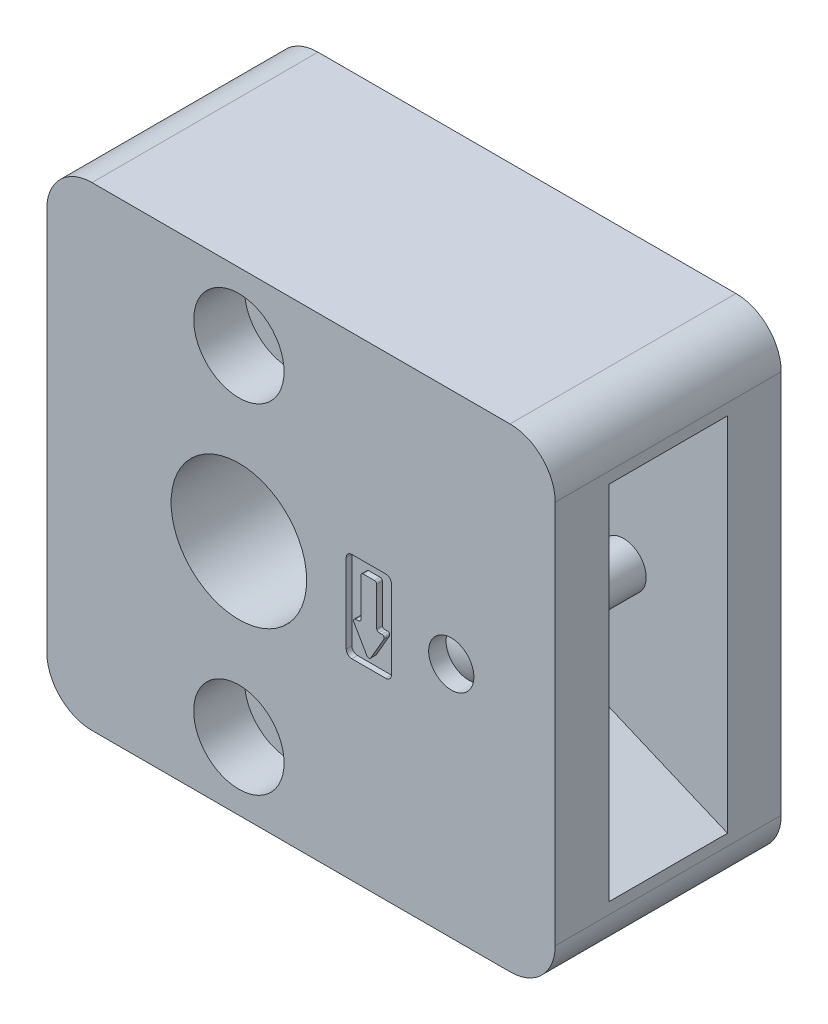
ISO-10303-21;
HEADER;
FILE_DESCRIPTION(('STEP AP214'),'2;1');
FILE_NAME('part.step','',(''),(''),'','','');
FILE_SCHEMA(('AUTOMOTIVE_DESIGN { 1 0 10303 214 1 1 1 1 }'));
ENDSEC;
DATA;
#1=APPLICATION_CONTEXT('core data for automotive mechanical design processes');
#2=APPLICATION_PROTOCOL_DEFINITION('international standard','automotive_design',2000,#1);
#3=PRODUCT_CONTEXT('',#1,'mechanical');
#4=PRODUCT('Part','Part','',(#3));
#5=PRODUCT_RELATED_PRODUCT_CATEGORY('part','',(#4));
#6=PRODUCT_DEFINITION_FORMATION('','',#4);
#7=PRODUCT_DEFINITION_CONTEXT('part definition',#1,'design');
#8=PRODUCT_DEFINITION('design','',#6,#7);
#9=PRODUCT_DEFINITION_SHAPE('','',#8);
#10=(LENGTH_UNIT() NAMED_UNIT(*) SI_UNIT(.MILLI.,.METRE.));
#11=(NAMED_UNIT(*) PLANE_ANGLE_UNIT() SI_UNIT($,.RADIAN.));
#12=(NAMED_UNIT(*) SI_UNIT($,.STERADIAN.) SOLID_ANGLE_UNIT());
#13=UNCERTAINTY_MEASURE_WITH_UNIT(LENGTH_MEASURE(1.E-05),#10,'distance_accuracy_value','');
#14=(GEOMETRIC_REPRESENTATION_CONTEXT(3) GLOBAL_UNCERTAINTY_ASSIGNED_CONTEXT((#13)) GLOBAL_UNIT_ASSIGNED_CONTEXT((#10,
#11,#12)) REPRESENTATION_CONTEXT('',''));
#15=CARTESIAN_POINT('',(0.,0.,0.));
#16=DIRECTION('',(0.,0.,1.));
#17=DIRECTION('',(1.,0.,0.));
#18=AXIS2_PLACEMENT_3D('',#15,#16,#17);
#19=CARTESIAN_POINT('',(18.8,0.,1.));
#20=DIRECTION('',(0.,0.,1.));
#21=DIRECTION('',(0.999190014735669,-0.0402407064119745,0.));
#22=AXIS2_PLACEMENT_3D('',#19,#20,#21);
#23=PLANE('',#22);
#24=CARTESIAN_POINT('',(18.8,0.,1.));
#25=DIRECTION('',(0.,0.,1.));
#26=DIRECTION('',(0.999190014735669,-0.0402407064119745,0.));
#27=AXIS2_PLACEMENT_3D('',#24,#25,#26);
#28=CIRCLE('',#27,1.8311920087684);
#29=CARTESIAN_POINT('',(20.6297087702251,-0.073688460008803,1.));
#30=VERTEX_POINT('',#29);
#31=EDGE_CURVE('E868',#30,#30,#28,.F.);
#32=ORIENTED_EDGE('',*,*,#31,.T.);
#33=EDGE_LOOP('',(#32));
#34=FACE_BOUND('',#33,.T.);
#35=ADVANCED_FACE('F14',(#34),#23,.F.);
#36=CARTESIAN_POINT('',(18.8,0.,1.63));
#37=DIRECTION('',(0.,0.,1.));
#38=DIRECTION('',(0.999190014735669,-0.0402407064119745,0.));
#39=AXIS2_PLACEMENT_3D('',#36,#37,#38);
#40=CONICAL_SURFACE('',#39,2.,0.261799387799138);
#41=CARTESIAN_POINT('',(18.8,0.,1.63));
#42=DIRECTION('',(0.,0.,-1.));
#43=DIRECTION('',(-0.999190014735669,0.0402407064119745,0.));
#44=AXIS2_PLACEMENT_3D('',#41,#42,#43);
#45=CIRCLE('',#44,2.);
#46=CARTESIAN_POINT('',(16.8016199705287,0.080481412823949,1.63));
#47=VERTEX_POINT('',#46);
#48=EDGE_CURVE('E861',#47,#47,#45,.T.);
#49=ORIENTED_EDGE('',*,*,#48,.T.);
#50=EDGE_LOOP('',(#49));
#51=FACE_BOUND('',#50,.T.);
#52=ORIENTED_EDGE('',*,*,#31,.F.);
#53=EDGE_LOOP('',(#52));
#54=FACE_BOUND('',#53,.T.);
#55=ADVANCED_FACE('F894',(#51,#54),#40,.T.);
#56=CARTESIAN_POINT('',(18.8,0.,15.));
#57=DIRECTION('',(0.,0.,1.));
#58=DIRECTION('',(0.999190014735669,-0.0402407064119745,0.));
#59=AXIS2_PLACEMENT_3D('',#56,#57,#58);
#60=SPHERICAL_SURFACE('',#59,4.);
#61=CARTESIAN_POINT('',(18.8,0.,18.4641016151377));
#62=DIRECTION('',(0.,0.,-1.));
#63=DIRECTION('',(-0.999190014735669,0.0402407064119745,0.));
#64=AXIS2_PLACEMENT_3D('',#61,#62,#63);
#65=CIRCLE('',#64,2.);
#66=CARTESIAN_POINT('',(16.8016199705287,0.080481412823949,18.4641016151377));
#67=VERTEX_POINT('',#66);
#68=EDGE_CURVE('E869',#67,#67,#65,.F.);
#69=ORIENTED_EDGE('',*,*,#68,.T.);
#70=EDGE_LOOP('',(#69));
#71=FACE_BOUND('',#70,.T.);
#72=ADVANCED_FACE('F880',(#71),#60,.T.);
#73=CARTESIAN_POINT('',(18.8,0.,19.));
#74=DIRECTION('',(0.,0.,-1.));
#75=DIRECTION('',(-0.999190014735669,0.0402407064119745,0.));
#76=AXIS2_PLACEMENT_3D('',#73,#74,#75);
#77=CYLINDRICAL_SURFACE('',#76,2.);
#78=CARTESIAN_POINT('',(18.8,0.,4.75));
#79=DIRECTION('',(0.,0.,1.));
#80=DIRECTION('',(1.,0.,0.));
#81=AXIS2_PLACEMENT_3D('',#78,#79,#80);
#82=CIRCLE('',#81,2.);
#83=CARTESIAN_POINT('',(20.8,0.,4.75));
#84=VERTEX_POINT('',#83);
#85=EDGE_CURVE('E9',#84,#84,#82,.T.);
#86=ORIENTED_EDGE('',*,*,#85,.T.);
#87=EDGE_LOOP('',(#86));
#88=FACE_BOUND('',#87,.T.);
#89=CARTESIAN_POINT('',(18.8,0.,15.25));
#90=DIRECTION('',(0.,0.,1.));
#91=DIRECTION('',(1.,0.,0.));
#92=AXIS2_PLACEMENT_3D('',#89,#90,#91);
#93=CIRCLE('',#92,2.);
#94=CARTESIAN_POINT('',(20.8,0.,15.25));
#95=VERTEX_POINT('',#94);
#96=EDGE_CURVE('E22',#95,#95,#93,.T.);
#97=ORIENTED_EDGE('',*,*,#96,.F.);
#98=EDGE_LOOP('',(#97));
#99=FACE_BOUND('',#98,.T.);
#100=ADVANCED_FACE('F16',(#88,#99),#77,.T.);
#101=CARTESIAN_POINT('',(11.5,-2.9980762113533,20.));
#102=DIRECTION('',(0.,0.,-1.));
#103=DIRECTION('',(-1.,0.,0.));
#104=AXIS2_PLACEMENT_3D('',#101,#102,#103);
#105=PLANE('',#104);
#106=CARTESIAN_POINT('',(11.5,-2.9980762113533,20.));
#107=DIRECTION('',(0.,0.,1.));
#108=DIRECTION('',(-1.,0.,0.));
#109=AXIS2_PLACEMENT_3D('',#106,#107,#108);
#110=CIRCLE('',#109,0.2);
#111=CARTESIAN_POINT('',(11.3267949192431,-3.0980762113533,20.));
#112=VERTEX_POINT('',#111);
#113=CARTESIAN_POINT('',(11.6732050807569,-3.0980762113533,20.));
#114=VERTEX_POINT('',#113);
#115=EDGE_CURVE('E589',#112,#114,#110,.T.);
#116=ORIENTED_EDGE('',*,*,#115,.T.);
#117=DIRECTION('',(0.5,0.866025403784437,0.));
#118=VECTOR('',#117,1.);
#119=CARTESIAN_POINT('',(12.8267949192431,-1.1,20.));
#120=LINE('',#119,#118);
#121=CARTESIAN_POINT('',(12.8267949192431,-1.1,20.));
#122=VERTEX_POINT('',#121);
#123=EDGE_CURVE('E592',#114,#122,#120,.T.);
#124=ORIENTED_EDGE('',*,*,#123,.T.);
#125=CARTESIAN_POINT('',(12.6535898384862,-1.,20.));
#126=DIRECTION('',(0.,0.,1.));
#127=DIRECTION('',(1.,0.,0.));
#128=AXIS2_PLACEMENT_3D('',#125,#126,#127);
#129=CIRCLE('',#128,0.2);
#130=CARTESIAN_POINT('',(12.6535898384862,-0.8,20.));
#131=VERTEX_POINT('',#130);
#132=EDGE_CURVE('E594',#122,#131,#129,.T.);
#133=ORIENTED_EDGE('',*,*,#132,.T.);
#134=DIRECTION('',(-1.,0.,0.));
#135=VECTOR('',#134,1.);
#136=CARTESIAN_POINT('',(12.4,-0.8,20.));
#137=LINE('',#136,#135);
#138=CARTESIAN_POINT('',(12.4,-0.8,20.));
#139=VERTEX_POINT('',#138);
#140=EDGE_CURVE('E596',#131,#139,#137,.T.);
#141=ORIENTED_EDGE('',*,*,#140,.T.);
#142=CARTESIAN_POINT('',(12.4,-0.6,20.));
#143=DIRECTION('',(0.,0.,-1.));
#144=DIRECTION('',(-1.,0.,0.));
#145=AXIS2_PLACEMENT_3D('',#142,#143,#144);
#146=CIRCLE('',#145,0.2);
#147=CARTESIAN_POINT('',(12.2,-0.6,20.));
#148=VERTEX_POINT('',#147);
#149=EDGE_CURVE('E598',#139,#148,#146,.T.);
#150=ORIENTED_EDGE('',*,*,#149,.T.);
#151=DIRECTION('',(0.,1.,0.));
#152=VECTOR('',#151,1.);
#153=CARTESIAN_POINT('',(12.2,2.8,20.));
#154=LINE('',#153,#152);
#155=CARTESIAN_POINT('',(12.2,2.8,20.));
#156=VERTEX_POINT('',#155);
#157=EDGE_CURVE('E600',#148,#156,#154,.T.);
#158=ORIENTED_EDGE('',*,*,#157,.T.);
#159=CARTESIAN_POINT('',(12.,2.8,20.));
#160=DIRECTION('',(0.,0.,1.));
#161=DIRECTION('',(1.,0.,0.));
#162=AXIS2_PLACEMENT_3D('',#159,#160,#161);
#163=CIRCLE('',#162,0.2);
#164=CARTESIAN_POINT('',(12.,3.,20.));
#165=VERTEX_POINT('',#164);
#166=EDGE_CURVE('E602',#156,#165,#163,.T.);
#167=ORIENTED_EDGE('',*,*,#166,.T.);
#168=DIRECTION('',(-1.,0.,0.));
#169=VECTOR('',#168,1.);
#170=CARTESIAN_POINT('',(12.,3.,20.));
#171=LINE('',#170,#169);
#172=CARTESIAN_POINT('',(11.,3.,20.));
#173=VERTEX_POINT('',#172);
#174=EDGE_CURVE('E604',#165,#173,#171,.T.);
#175=ORIENTED_EDGE('',*,*,#174,.T.);
#176=CARTESIAN_POINT('',(11.,2.8,20.));
#177=DIRECTION('',(0.,0.,1.));
#178=DIRECTION('',(-1.,0.,0.));
#179=AXIS2_PLACEMENT_3D('',#176,#177,#178);
#180=CIRCLE('',#179,0.2);
#181=CARTESIAN_POINT('',(10.8,2.8,20.));
#182=VERTEX_POINT('',#181);
#183=EDGE_CURVE('E606',#173,#182,#180,.T.);
#184=ORIENTED_EDGE('',*,*,#183,.T.);
#185=DIRECTION('',(0.,-1.,0.));
#186=VECTOR('',#185,1.);
#187=CARTESIAN_POINT('',(10.8,2.8,20.));
#188=LINE('',#187,#186);
#189=CARTESIAN_POINT('',(10.8,-0.6,20.));
#190=VERTEX_POINT('',#189);
#191=EDGE_CURVE('E608',#182,#190,#188,.T.);
#192=ORIENTED_EDGE('',*,*,#191,.T.);
#193=CARTESIAN_POINT('',(10.6,-0.6,20.));
#194=DIRECTION('',(0.,0.,-1.));
#195=DIRECTION('',(1.,0.,0.));
#196=AXIS2_PLACEMENT_3D('',#193,#194,#195);
#197=CIRCLE('',#196,0.2);
#198=CARTESIAN_POINT('',(10.6,-0.8,20.));
#199=VERTEX_POINT('',#198);
#200=EDGE_CURVE('E610',#190,#199,#197,.T.);
#201=ORIENTED_EDGE('',*,*,#200,.T.);
#202=DIRECTION('',(-1.,0.,0.));
#203=VECTOR('',#202,1.);
#204=CARTESIAN_POINT('',(10.6,-0.8,20.));
#205=LINE('',#204,#203);
#206=CARTESIAN_POINT('',(10.3464101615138,-0.8,20.));
#207=VERTEX_POINT('',#206);
#208=EDGE_CURVE('E612',#199,#207,#205,.T.);
#209=ORIENTED_EDGE('',*,*,#208,.T.);
#210=CARTESIAN_POINT('',(10.3464101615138,-1.,20.));
#211=DIRECTION('',(0.,0.,1.));
#212=DIRECTION('',(-1.,0.,0.));
#213=AXIS2_PLACEMENT_3D('',#210,#211,#212);
#214=CIRCLE('',#213,0.2);
#215=CARTESIAN_POINT('',(10.1732050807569,-1.1,20.));
#216=VERTEX_POINT('',#215);
#217=EDGE_CURVE('E614',#207,#216,#214,.T.);
#218=ORIENTED_EDGE('',*,*,#217,.T.);
#219=DIRECTION('',(0.5,-0.866025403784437,0.));
#220=VECTOR('',#219,1.);
#221=CARTESIAN_POINT('',(10.1732050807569,-1.1,20.));
#222=LINE('',#221,#220);
#223=EDGE_CURVE('E616',#216,#112,#222,.T.);
#224=ORIENTED_EDGE('',*,*,#223,.T.);
#225=EDGE_LOOP('',(#116,#124,#133,#141,#150,#158,#167,#175,#184,#192,#201,#209,#218,#224));
#226=FACE_BOUND('',#225,.T.);
#227=ADVANCED_FACE('F879',(#226),#105,.F.);
#228=CARTESIAN_POINT('',(11.5,-2.9980762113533,0.));
#229=DIRECTION('',(0.,0.,1.));
#230=DIRECTION('',(-1.,0.,0.));
#231=AXIS2_PLACEMENT_3D('',#228,#229,#230);
#232=PLANE('',#231);
#233=CARTESIAN_POINT('',(11.5,-2.9980762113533,0.));
#234=DIRECTION('',(0.,0.,1.));
#235=DIRECTION('',(-1.,0.,0.));
#236=AXIS2_PLACEMENT_3D('',#233,#234,#235);
#237=CIRCLE('',#236,0.2);
#238=CARTESIAN_POINT('',(11.3267949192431,-3.0980762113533,0.));
#239=VERTEX_POINT('',#238);
#240=CARTESIAN_POINT('',(11.6732050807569,-3.0980762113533,0.));
#241=VERTEX_POINT('',#240);
#242=EDGE_CURVE('E429',#239,#241,#237,.T.);
#243=ORIENTED_EDGE('',*,*,#242,.F.);
#244=DIRECTION('',(0.5,-0.866025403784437,0.));
#245=VECTOR('',#244,1.);
#246=CARTESIAN_POINT('',(10.1732050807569,-1.1,0.));
#247=LINE('',#246,#245);
#248=CARTESIAN_POINT('',(10.1732050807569,-1.1,0.));
#249=VERTEX_POINT('',#248);
#250=EDGE_CURVE('E376',#249,#239,#247,.T.);
#251=ORIENTED_EDGE('',*,*,#250,.F.);
#252=CARTESIAN_POINT('',(10.3464101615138,-1.,0.));
#253=DIRECTION('',(0.,0.,1.));
#254=DIRECTION('',(-1.,0.,0.));
#255=AXIS2_PLACEMENT_3D('',#252,#253,#254);
#256=CIRCLE('',#255,0.2);
#257=CARTESIAN_POINT('',(10.3464101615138,-0.8,0.));
#258=VERTEX_POINT('',#257);
#259=EDGE_CURVE('E432',#258,#249,#256,.T.);
#260=ORIENTED_EDGE('',*,*,#259,.F.);
#261=DIRECTION('',(-1.,0.,0.));
#262=VECTOR('',#261,1.);
#263=CARTESIAN_POINT('',(10.6,-0.8,0.));
#264=LINE('',#263,#262);
#265=CARTESIAN_POINT('',(10.6,-0.8,0.));
#266=VERTEX_POINT('',#265);
#267=EDGE_CURVE('E435',#266,#258,#264,.T.);
#268=ORIENTED_EDGE('',*,*,#267,.F.);
#269=CARTESIAN_POINT('',(10.6,-0.6,0.));
#270=DIRECTION('',(0.,0.,-1.));
#271=DIRECTION('',(1.,0.,0.));
#272=AXIS2_PLACEMENT_3D('',#269,#270,#271);
#273=CIRCLE('',#272,0.2);
#274=CARTESIAN_POINT('',(10.8,-0.6,0.));
#275=VERTEX_POINT('',#274);
#276=EDGE_CURVE('E438',#275,#266,#273,.T.);
#277=ORIENTED_EDGE('',*,*,#276,.F.);
#278=DIRECTION('',(0.,-1.,0.));
#279=VECTOR('',#278,1.);
#280=CARTESIAN_POINT('',(10.8,2.8,0.));
#281=LINE('',#280,#279);
#282=CARTESIAN_POINT('',(10.8,2.8,0.));
#283=VERTEX_POINT('',#282);
#284=EDGE_CURVE('E441',#283,#275,#281,.T.);
#285=ORIENTED_EDGE('',*,*,#284,.F.);
#286=CARTESIAN_POINT('',(11.,2.8,0.));
#287=DIRECTION('',(0.,0.,1.));
#288=DIRECTION('',(-1.,0.,0.));
#289=AXIS2_PLACEMENT_3D('',#286,#287,#288);
#290=CIRCLE('',#289,0.2);
#291=CARTESIAN_POINT('',(11.,3.,0.));
#292=VERTEX_POINT('',#291);
#293=EDGE_CURVE('E444',#292,#283,#290,.T.);
#294=ORIENTED_EDGE('',*,*,#293,.F.);
#295=DIRECTION('',(-1.,0.,0.));
#296=VECTOR('',#295,1.);
#297=CARTESIAN_POINT('',(12.,3.,0.));
#298=LINE('',#297,#296);
#299=CARTESIAN_POINT('',(12.,3.,0.));
#300=VERTEX_POINT('',#299);
#301=EDGE_CURVE('E447',#300,#292,#298,.T.);
#302=ORIENTED_EDGE('',*,*,#301,.F.);
#303=CARTESIAN_POINT('',(12.,2.8,0.));
#304=DIRECTION('',(0.,0.,1.));
#305=DIRECTION('',(1.,0.,0.));
#306=AXIS2_PLACEMENT_3D('',#303,#304,#305);
#307=CIRCLE('',#306,0.2);
#308=CARTESIAN_POINT('',(12.2,2.8,0.));
#309=VERTEX_POINT('',#308);
#310=EDGE_CURVE('E450',#309,#300,#307,.T.);
#311=ORIENTED_EDGE('',*,*,#310,.F.);
#312=DIRECTION('',(0.,1.,0.));
#313=VECTOR('',#312,1.);
#314=CARTESIAN_POINT('',(12.2,2.8,0.));
#315=LINE('',#314,#313);
#316=CARTESIAN_POINT('',(12.2,-0.6,0.));
#317=VERTEX_POINT('',#316);
#318=EDGE_CURVE('E453',#317,#309,#315,.T.);
#319=ORIENTED_EDGE('',*,*,#318,.F.);
#320=CARTESIAN_POINT('',(12.4,-0.6,0.));
#321=DIRECTION('',(0.,0.,-1.));
#322=DIRECTION('',(-1.,0.,0.));
#323=AXIS2_PLACEMENT_3D('',#320,#321,#322);
#324=CIRCLE('',#323,0.2);
#325=CARTESIAN_POINT('',(12.4,-0.8,0.));
#326=VERTEX_POINT('',#325);
#327=EDGE_CURVE('E456',#326,#317,#324,.T.);
#328=ORIENTED_EDGE('',*,*,#327,.F.);
#329=DIRECTION('',(-1.,0.,0.));
#330=VECTOR('',#329,1.);
#331=CARTESIAN_POINT('',(12.4,-0.8,0.));
#332=LINE('',#331,#330);
#333=CARTESIAN_POINT('',(12.6535898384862,-0.8,0.));
#334=VERTEX_POINT('',#333);
#335=EDGE_CURVE('E459',#334,#326,#332,.T.);
#336=ORIENTED_EDGE('',*,*,#335,.F.);
#337=CARTESIAN_POINT('',(12.6535898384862,-1.,0.));
#338=DIRECTION('',(0.,0.,1.));
#339=DIRECTION('',(1.,0.,0.));
#340=AXIS2_PLACEMENT_3D('',#337,#338,#339);
#341=CIRCLE('',#340,0.2);
#342=CARTESIAN_POINT('',(12.8267949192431,-1.1,0.));
#343=VERTEX_POINT('',#342);
#344=EDGE_CURVE('E462',#343,#334,#341,.T.);
#345=ORIENTED_EDGE('',*,*,#344,.F.);
#346=DIRECTION('',(0.5,0.866025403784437,0.));
#347=VECTOR('',#346,1.);
#348=CARTESIAN_POINT('',(12.8267949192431,-1.1,0.));
#349=LINE('',#348,#347);
#350=EDGE_CURVE('E465',#241,#343,#349,.T.);
#351=ORIENTED_EDGE('',*,*,#350,.F.);
#352=EDGE_LOOP('',(#243,#251,#260,#268,#277,#285,#294,#302,#311,#319,#328,#336,#345,#351));
#353=FACE_BOUND('',#352,.T.);
#354=ADVANCED_FACE('F889',(#353),#232,.F.);
#355=CARTESIAN_POINT('',(12.8267949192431,-1.1,20.));
#356=DIRECTION('',(-0.866025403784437,0.5,0.));
#357=DIRECTION('',(-0.5,-0.866025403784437,0.));
#358=AXIS2_PLACEMENT_3D('',#355,#356,#357);
#359=PLANE('',#358);
#360=DIRECTION('',(0.5,0.866025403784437,0.));
#361=VECTOR('',#360,1.);
#362=CARTESIAN_POINT('',(12.8267949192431,-1.1,19.5));
#363=LINE('',#362,#361);
#364=CARTESIAN_POINT('',(11.6732050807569,-3.0980762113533,19.5));
#365=VERTEX_POINT('',#364);
#366=CARTESIAN_POINT('',(12.8267949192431,-1.1,19.5));
#367=VERTEX_POINT('',#366);
#368=EDGE_CURVE('E550',#365,#367,#363,.T.);
#369=ORIENTED_EDGE('',*,*,#368,.T.);
#370=DIRECTION('',(0.,0.,-1.));
#371=VECTOR('',#370,1.);
#372=CARTESIAN_POINT('',(12.8267949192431,-1.1,20.));
#373=LINE('',#372,#371);
#374=EDGE_CURVE('E654',#122,#367,#373,.T.);
#375=ORIENTED_EDGE('',*,*,#374,.F.);
#376=ORIENTED_EDGE('',*,*,#123,.F.);
#377=DIRECTION('',(0.,0.,-1.));
#378=VECTOR('',#377,1.);
#379=CARTESIAN_POINT('',(11.6732050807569,-3.0980762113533,20.));
#380=LINE('',#379,#378);
#381=EDGE_CURVE('E657',#114,#365,#380,.T.);
#382=ORIENTED_EDGE('',*,*,#381,.T.);
#383=EDGE_LOOP('',(#369,#375,#376,#382));
#384=FACE_BOUND('',#383,.T.);
#385=ADVANCED_FACE('F1061',(#384),#359,.F.);
#386=CARTESIAN_POINT('',(12.6535898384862,-1.,20.));
#387=DIRECTION('',(0.,0.,-1.));
#388=DIRECTION('',(-1.,0.,0.));
#389=AXIS2_PLACEMENT_3D('',#386,#387,#388);
#390=CYLINDRICAL_SURFACE('',#389,0.2);
#391=CARTESIAN_POINT('',(12.6535898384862,-1.,19.5));
#392=DIRECTION('',(0.,0.,1.));
#393=DIRECTION('',(1.,0.,0.));
#394=AXIS2_PLACEMENT_3D('',#391,#392,#393);
#395=CIRCLE('',#394,0.2);
#396=CARTESIAN_POINT('',(12.6535898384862,-0.8,19.5));
#397=VERTEX_POINT('',#396);
#398=EDGE_CURVE('E553',#367,#397,#395,.T.);
#399=ORIENTED_EDGE('',*,*,#398,.T.);
#400=DIRECTION('',(0.,0.,-1.));
#401=VECTOR('',#400,1.);
#402=CARTESIAN_POINT('',(12.6535898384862,-0.8,20.));
#403=LINE('',#402,#401);
#404=EDGE_CURVE('E651',#131,#397,#403,.T.);
#405=ORIENTED_EDGE('',*,*,#404,.F.);
#406=ORIENTED_EDGE('',*,*,#132,.F.);
#407=ORIENTED_EDGE('',*,*,#374,.T.);
#408=EDGE_LOOP('',(#399,#405,#406,#407));
#409=FACE_BOUND('',#408,.T.);
#410=ADVANCED_FACE('F1064',(#409),#390,.T.);
#411=CARTESIAN_POINT('',(12.4,-0.8,20.));
#412=DIRECTION('',(0.,-1.,0.));
#413=DIRECTION('',(1.,0.,0.));
#414=AXIS2_PLACEMENT_3D('',#411,#412,#413);
#415=PLANE('',#414);
#416=DIRECTION('',(-1.,0.,0.));
#417=VECTOR('',#416,1.);
#418=CARTESIAN_POINT('',(12.4,-0.8,19.5));
#419=LINE('',#418,#417);
#420=CARTESIAN_POINT('',(12.4,-0.8,19.5));
#421=VERTEX_POINT('',#420);
#422=EDGE_CURVE('E556',#397,#421,#419,.T.);
#423=ORIENTED_EDGE('',*,*,#422,.T.);
#424=DIRECTION('',(0.,0.,-1.));
#425=VECTOR('',#424,1.);
#426=CARTESIAN_POINT('',(12.4,-0.8,20.));
#427=LINE('',#426,#425);
#428=EDGE_CURVE('E648',#139,#421,#427,.T.);
#429=ORIENTED_EDGE('',*,*,#428,.F.);
#430=ORIENTED_EDGE('',*,*,#140,.F.);
#431=ORIENTED_EDGE('',*,*,#404,.T.);
#432=EDGE_LOOP('',(#423,#429,#430,#431));
#433=FACE_BOUND('',#432,.T.);
#434=ADVANCED_FACE('F1068',(#433),#415,.F.);
#435=CARTESIAN_POINT('',(12.4,-0.6,20.));
#436=DIRECTION('',(0.,0.,-1.));
#437=DIRECTION('',(-1.,0.,0.));
#438=AXIS2_PLACEMENT_3D('',#435,#436,#437);
#439=CYLINDRICAL_SURFACE('',#438,0.2);
#440=CARTESIAN_POINT('',(12.4,-0.6,19.5));
#441=DIRECTION('',(0.,0.,-1.));
#442=DIRECTION('',(-1.,0.,0.));
#443=AXIS2_PLACEMENT_3D('',#440,#441,#442);
#444=CIRCLE('',#443,0.2);
#445=CARTESIAN_POINT('',(12.2,-0.6,19.5));
#446=VERTEX_POINT('',#445);
#447=EDGE_CURVE('E559',#421,#446,#444,.T.);
#448=ORIENTED_EDGE('',*,*,#447,.T.);
#449=DIRECTION('',(0.,0.,-1.));
#450=VECTOR('',#449,1.);
#451=CARTESIAN_POINT('',(12.2,-0.6,20.));
#452=LINE('',#451,#450);
#453=EDGE_CURVE('E645',#148,#446,#452,.T.);
#454=ORIENTED_EDGE('',*,*,#453,.F.);
#455=ORIENTED_EDGE('',*,*,#149,.F.);
#456=ORIENTED_EDGE('',*,*,#428,.T.);
#457=EDGE_LOOP('',(#448,#454,#455,#456));
#458=FACE_BOUND('',#457,.T.);
#459=ADVANCED_FACE('F1072',(#458),#439,.F.);
#460=CARTESIAN_POINT('',(12.2,2.8,20.));
#461=DIRECTION('',(-1.,0.,0.));
#462=DIRECTION('',(0.,0.,1.));
#463=AXIS2_PLACEMENT_3D('',#460,#461,#462);
#464=PLANE('',#463);
#465=DIRECTION('',(0.,1.,0.));
#466=VECTOR('',#465,1.);
#467=CARTESIAN_POINT('',(12.2,2.8,19.5));
#468=LINE('',#467,#466);
#469=CARTESIAN_POINT('',(12.2,2.8,19.5));
#470=VERTEX_POINT('',#469);
#471=EDGE_CURVE('E562',#446,#470,#468,.T.);
#472=ORIENTED_EDGE('',*,*,#471,.T.);
#473=DIRECTION('',(0.,0.,-1.));
#474=VECTOR('',#473,1.);
#475=CARTESIAN_POINT('',(12.2,2.8,20.));
#476=LINE('',#475,#474);
#477=EDGE_CURVE('E642',#156,#470,#476,.T.);
#478=ORIENTED_EDGE('',*,*,#477,.F.);
#479=ORIENTED_EDGE('',*,*,#157,.F.);
#480=ORIENTED_EDGE('',*,*,#453,.T.);
#481=EDGE_LOOP('',(#472,#478,#479,#480));
#482=FACE_BOUND('',#481,.T.);
#483=ADVANCED_FACE('F1076',(#482),#464,.F.);
#484=CARTESIAN_POINT('',(12.,2.8,20.));
#485=DIRECTION('',(0.,0.,-1.));
#486=DIRECTION('',(-1.,0.,0.));
#487=AXIS2_PLACEMENT_3D('',#484,#485,#486);
#488=CYLINDRICAL_SURFACE('',#487,0.2);
#489=CARTESIAN_POINT('',(12.,2.8,19.5));
#490=DIRECTION('',(0.,0.,1.));
#491=DIRECTION('',(1.,0.,0.));
#492=AXIS2_PLACEMENT_3D('',#489,#490,#491);
#493=CIRCLE('',#492,0.2);
#494=CARTESIAN_POINT('',(12.,3.,19.5));
#495=VERTEX_POINT('',#494);
#496=EDGE_CURVE('E565',#470,#495,#493,.T.);
#497=ORIENTED_EDGE('',*,*,#496,.T.);
#498=DIRECTION('',(0.,0.,-1.));
#499=VECTOR('',#498,1.);
#500=CARTESIAN_POINT('',(12.,3.,20.));
#501=LINE('',#500,#499);
#502=EDGE_CURVE('E639',#165,#495,#501,.T.);
#503=ORIENTED_EDGE('',*,*,#502,.F.);
#504=ORIENTED_EDGE('',*,*,#166,.F.);
#505=ORIENTED_EDGE('',*,*,#477,.T.);
#506=EDGE_LOOP('',(#497,#503,#504,#505));
#507=FACE_BOUND('',#506,.T.);
#508=ADVANCED_FACE('F1080',(#507),#488,.T.);
#509=CARTESIAN_POINT('',(12.,3.,20.));
#510=DIRECTION('',(0.,-1.,0.));
#511=DIRECTION('',(0.,0.,-1.));
#512=AXIS2_PLACEMENT_3D('',#509,#510,#511);
#513=PLANE('',#512);
#514=DIRECTION('',(-1.,0.,0.));
#515=VECTOR('',#514,1.);
#516=CARTESIAN_POINT('',(12.,3.,19.5));
#517=LINE('',#516,#515);
#518=CARTESIAN_POINT('',(11.,3.,19.5));
#519=VERTEX_POINT('',#518);
#520=EDGE_CURVE('E568',#495,#519,#517,.T.);
#521=ORIENTED_EDGE('',*,*,#520,.T.);
#522=DIRECTION('',(0.,0.,-1.));
#523=VECTOR('',#522,1.);
#524=CARTESIAN_POINT('',(11.,3.,20.));
#525=LINE('',#524,#523);
#526=EDGE_CURVE('E636',#173,#519,#525,.T.);
#527=ORIENTED_EDGE('',*,*,#526,.F.);
#528=ORIENTED_EDGE('',*,*,#174,.F.);
#529=ORIENTED_EDGE('',*,*,#502,.T.);
#530=EDGE_LOOP('',(#521,#527,#528,#529));
#531=FACE_BOUND('',#530,.T.);
#532=ADVANCED_FACE('F1084',(#531),#513,.F.);
#533=CARTESIAN_POINT('',(11.,2.8,20.));
#534=DIRECTION('',(0.,0.,-1.));
#535=DIRECTION('',(-1.,0.,0.));
#536=AXIS2_PLACEMENT_3D('',#533,#534,#535);
#537=CYLINDRICAL_SURFACE('',#536,0.2);
#538=CARTESIAN_POINT('',(11.,2.8,19.5));
#539=DIRECTION('',(0.,0.,1.));
#540=DIRECTION('',(-1.,0.,0.));
#541=AXIS2_PLACEMENT_3D('',#538,#539,#540);
#542=CIRCLE('',#541,0.2);
#543=CARTESIAN_POINT('',(10.8,2.8,19.5));
#544=VERTEX_POINT('',#543);
#545=EDGE_CURVE('E571',#519,#544,#542,.T.);
#546=ORIENTED_EDGE('',*,*,#545,.T.);
#547=DIRECTION('',(0.,0.,-1.));
#548=VECTOR('',#547,1.);
#549=CARTESIAN_POINT('',(10.8,2.8,20.));
#550=LINE('',#549,#548);
#551=EDGE_CURVE('E633',#182,#544,#550,.T.);
#552=ORIENTED_EDGE('',*,*,#551,.F.);
#553=ORIENTED_EDGE('',*,*,#183,.F.);
#554=ORIENTED_EDGE('',*,*,#526,.T.);
#555=EDGE_LOOP('',(#546,#552,#553,#554));
#556=FACE_BOUND('',#555,.T.);
#557=ADVANCED_FACE('F1088',(#556),#537,.T.);
#558=CARTESIAN_POINT('',(10.8,2.8,20.));
#559=DIRECTION('',(1.,0.,0.));
#560=DIRECTION('',(0.,1.,0.));
#561=AXIS2_PLACEMENT_3D('',#558,#559,#560);
#562=PLANE('',#561);
#563=DIRECTION('',(0.,-1.,0.));
#564=VECTOR('',#563,1.);
#565=CARTESIAN_POINT('',(10.8,2.8,19.5));
#566=LINE('',#565,#564);
#567=CARTESIAN_POINT('',(10.8,-0.6,19.5));
#568=VERTEX_POINT('',#567);
#569=EDGE_CURVE('E574',#544,#568,#566,.T.);
#570=ORIENTED_EDGE('',*,*,#569,.T.);
#571=DIRECTION('',(0.,0.,-1.));
#572=VECTOR('',#571,1.);
#573=CARTESIAN_POINT('',(10.8,-0.6,20.));
#574=LINE('',#573,#572);
#575=EDGE_CURVE('E630',#190,#568,#574,.T.);
#576=ORIENTED_EDGE('',*,*,#575,.F.);
#577=ORIENTED_EDGE('',*,*,#191,.F.);
#578=ORIENTED_EDGE('',*,*,#551,.T.);
#579=EDGE_LOOP('',(#570,#576,#577,#578));
#580=FACE_BOUND('',#579,.T.);
#581=ADVANCED_FACE('F1092',(#580),#562,.F.);
#582=CARTESIAN_POINT('',(10.6,-0.6,20.));
#583=DIRECTION('',(0.,0.,-1.));
#584=DIRECTION('',(-1.,0.,0.));
#585=AXIS2_PLACEMENT_3D('',#582,#583,#584);
#586=CYLINDRICAL_SURFACE('',#585,0.2);
#587=CARTESIAN_POINT('',(10.6,-0.6,19.5));
#588=DIRECTION('',(0.,0.,-1.));
#589=DIRECTION('',(1.,0.,0.));
#590=AXIS2_PLACEMENT_3D('',#587,#588,#589);
#591=CIRCLE('',#590,0.2);
#592=CARTESIAN_POINT('',(10.6,-0.8,19.5));
#593=VERTEX_POINT('',#592);
#594=EDGE_CURVE('E577',#568,#593,#591,.T.);
#595=ORIENTED_EDGE('',*,*,#594,.T.);
#596=DIRECTION('',(0.,0.,-1.));
#597=VECTOR('',#596,1.);
#598=CARTESIAN_POINT('',(10.6,-0.8,20.));
#599=LINE('',#598,#597);
#600=EDGE_CURVE('E627',#199,#593,#599,.T.);
#601=ORIENTED_EDGE('',*,*,#600,.F.);
#602=ORIENTED_EDGE('',*,*,#200,.F.);
#603=ORIENTED_EDGE('',*,*,#575,.T.);
#604=EDGE_LOOP('',(#595,#601,#602,#603));
#605=FACE_BOUND('',#604,.T.);
#606=ADVANCED_FACE('F1096',(#605),#586,.F.);
#607=CARTESIAN_POINT('',(10.6,-0.8,20.));
#608=DIRECTION('',(0.,-1.,0.));
#609=DIRECTION('',(1.,0.,0.));
#610=AXIS2_PLACEMENT_3D('',#607,#608,#609);
#611=PLANE('',#610);
#612=DIRECTION('',(-1.,0.,0.));
#613=VECTOR('',#612,1.);
#614=CARTESIAN_POINT('',(10.6,-0.8,19.5));
#615=LINE('',#614,#613);
#616=CARTESIAN_POINT('',(10.3464101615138,-0.8,19.5));
#617=VERTEX_POINT('',#616);
#618=EDGE_CURVE('E580',#593,#617,#615,.T.);
#619=ORIENTED_EDGE('',*,*,#618,.T.);
#620=DIRECTION('',(0.,0.,-1.));
#621=VECTOR('',#620,1.);
#622=CARTESIAN_POINT('',(10.3464101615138,-0.8,20.));
#623=LINE('',#622,#621);
#624=EDGE_CURVE('E624',#207,#617,#623,.T.);
#625=ORIENTED_EDGE('',*,*,#624,.F.);
#626=ORIENTED_EDGE('',*,*,#208,.F.);
#627=ORIENTED_EDGE('',*,*,#600,.T.);
#628=EDGE_LOOP('',(#619,#625,#626,#627));
#629=FACE_BOUND('',#628,.T.);
#630=ADVANCED_FACE('F1100',(#629),#611,.F.);
#631=CARTESIAN_POINT('',(10.3464101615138,-1.,20.));
#632=DIRECTION('',(0.,0.,-1.));
#633=DIRECTION('',(-1.,0.,0.));
#634=AXIS2_PLACEMENT_3D('',#631,#632,#633);
#635=CYLINDRICAL_SURFACE('',#634,0.2);
#636=CARTESIAN_POINT('',(10.3464101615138,-1.,19.5));
#637=DIRECTION('',(0.,0.,1.));
#638=DIRECTION('',(-1.,0.,0.));
#639=AXIS2_PLACEMENT_3D('',#636,#637,#638);
#640=CIRCLE('',#639,0.2);
#641=CARTESIAN_POINT('',(10.1732050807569,-1.1,19.5));
#642=VERTEX_POINT('',#641);
#643=EDGE_CURVE('E583',#617,#642,#640,.T.);
#644=ORIENTED_EDGE('',*,*,#643,.T.);
#645=DIRECTION('',(0.,0.,-1.));
#646=VECTOR('',#645,1.);
#647=CARTESIAN_POINT('',(10.1732050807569,-1.1,20.));
#648=LINE('',#647,#646);
#649=EDGE_CURVE('E621',#216,#642,#648,.T.);
#650=ORIENTED_EDGE('',*,*,#649,.F.);
#651=ORIENTED_EDGE('',*,*,#217,.F.);
#652=ORIENTED_EDGE('',*,*,#624,.T.);
#653=EDGE_LOOP('',(#644,#650,#651,#652));
#654=FACE_BOUND('',#653,.T.);
#655=ADVANCED_FACE('F1104',(#654),#635,.T.);
#656=CARTESIAN_POINT('',(10.1732050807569,-1.1,20.));
#657=DIRECTION('',(0.866025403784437,0.5,0.));
#658=DIRECTION('',(-0.5,0.866025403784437,0.));
#659=AXIS2_PLACEMENT_3D('',#656,#657,#658);
#660=PLANE('',#659);
#661=DIRECTION('',(0.5,-0.866025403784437,0.));
#662=VECTOR('',#661,1.);
#663=CARTESIAN_POINT('',(10.1732050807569,-1.1,19.5));
#664=LINE('',#663,#662);
#665=CARTESIAN_POINT('',(11.3267949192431,-3.0980762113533,19.5));
#666=VERTEX_POINT('',#665);
#667=EDGE_CURVE('E586',#642,#666,#664,.T.);
#668=ORIENTED_EDGE('',*,*,#667,.T.);
#669=DIRECTION('',(0.,0.,-1.));
#670=VECTOR('',#669,1.);
#671=CARTESIAN_POINT('',(11.3267949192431,-3.0980762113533,20.));
#672=LINE('',#671,#670);
#673=EDGE_CURVE('E618',#112,#666,#672,.T.);
#674=ORIENTED_EDGE('',*,*,#673,.F.);
#675=ORIENTED_EDGE('',*,*,#223,.F.);
#676=ORIENTED_EDGE('',*,*,#649,.T.);
#677=EDGE_LOOP('',(#668,#674,#675,#676));
#678=FACE_BOUND('',#677,.T.);
#679=ADVANCED_FACE('F893',(#678),#660,.F.);
#680=CARTESIAN_POINT('',(11.5,-2.9980762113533,20.));
#681=DIRECTION('',(0.,0.,-1.));
#682=DIRECTION('',(-1.,0.,0.));
#683=AXIS2_PLACEMENT_3D('',#680,#681,#682);
#684=CYLINDRICAL_SURFACE('',#683,0.2);
#685=CARTESIAN_POINT('',(11.5,-2.9980762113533,19.5));
#686=DIRECTION('',(0.,0.,1.));
#687=DIRECTION('',(-1.,0.,0.));
#688=AXIS2_PLACEMENT_3D('',#685,#686,#687);
#689=CIRCLE('',#688,0.2);
#690=EDGE_CURVE('E534',#666,#365,#689,.T.);
#691=ORIENTED_EDGE('',*,*,#690,.T.);
#692=ORIENTED_EDGE('',*,*,#381,.F.);
#693=ORIENTED_EDGE('',*,*,#115,.F.);
#694=ORIENTED_EDGE('',*,*,#673,.T.);
#695=EDGE_LOOP('',(#691,#692,#693,#694));
#696=FACE_BOUND('',#695,.T.);
#697=ADVANCED_FACE('F1031',(#696),#684,.T.);
#698=CARTESIAN_POINT('',(10.3464101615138,-1.,0.));
#699=DIRECTION('',(0.,0.,1.));
#700=DIRECTION('',(1.,0.,0.));
#701=AXIS2_PLACEMENT_3D('',#698,#699,#700);
#702=CYLINDRICAL_SURFACE('',#701,0.2);
#703=CARTESIAN_POINT('',(10.3464101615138,-1.,0.5));
#704=DIRECTION('',(0.,0.,1.));
#705=DIRECTION('',(-1.,0.,0.));
#706=AXIS2_PLACEMENT_3D('',#703,#704,#705);
#707=CIRCLE('',#706,0.2);
#708=CARTESIAN_POINT('',(10.3464101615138,-0.8,0.5));
#709=VERTEX_POINT('',#708);
#710=CARTESIAN_POINT('',(10.1732050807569,-1.1,0.5));
#711=VERTEX_POINT('',#710);
#712=EDGE_CURVE('E395',#709,#711,#707,.T.);
#713=ORIENTED_EDGE('',*,*,#712,.F.);
#714=DIRECTION('',(0.,0.,1.));
#715=VECTOR('',#714,1.);
#716=CARTESIAN_POINT('',(10.3464101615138,-0.8,0.));
#717=LINE('',#716,#715);
#718=EDGE_CURVE('E489',#258,#709,#717,.T.);
#719=ORIENTED_EDGE('',*,*,#718,.F.);
#720=ORIENTED_EDGE('',*,*,#259,.T.);
#721=DIRECTION('',(0.,0.,1.));
#722=VECTOR('',#721,1.);
#723=CARTESIAN_POINT('',(10.1732050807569,-1.1,0.));
#724=LINE('',#723,#722);
#725=EDGE_CURVE('E380',#249,#711,#724,.T.);
#726=ORIENTED_EDGE('',*,*,#725,.T.);
#727=EDGE_LOOP('',(#713,#719,#720,#726));
#728=FACE_BOUND('',#727,.T.);
#729=ADVANCED_FACE('F1059',(#728),#702,.T.);
#730=CARTESIAN_POINT('',(10.6,-0.8,0.));
#731=DIRECTION('',(0.,1.,0.));
#732=DIRECTION('',(-1.,0.,0.));
#733=AXIS2_PLACEMENT_3D('',#730,#731,#732);
#734=PLANE('',#733);
#735=DIRECTION('',(-1.,0.,0.));
#736=VECTOR('',#735,1.);
#737=CARTESIAN_POINT('',(10.6,-0.8,0.5));
#738=LINE('',#737,#736);
#739=CARTESIAN_POINT('',(10.6,-0.8,0.5));
#740=VERTEX_POINT('',#739);
#741=EDGE_CURVE('E397',#740,#709,#738,.T.);
#742=ORIENTED_EDGE('',*,*,#741,.F.);
#743=DIRECTION('',(0.,0.,1.));
#744=VECTOR('',#743,1.);
#745=CARTESIAN_POINT('',(10.6,-0.8,0.));
#746=LINE('',#745,#744);
#747=EDGE_CURVE('E487',#266,#740,#746,.T.);
#748=ORIENTED_EDGE('',*,*,#747,.F.);
#749=ORIENTED_EDGE('',*,*,#267,.T.);
#750=ORIENTED_EDGE('',*,*,#718,.T.);
#751=EDGE_LOOP('',(#742,#748,#749,#750));
#752=FACE_BOUND('',#751,.T.);
#753=ADVANCED_FACE('F1149',(#752),#734,.T.);
#754=CARTESIAN_POINT('',(10.6,-0.6,0.));
#755=DIRECTION('',(0.,0.,1.));
#756=DIRECTION('',(1.,0.,0.));
#757=AXIS2_PLACEMENT_3D('',#754,#755,#756);
#758=CYLINDRICAL_SURFACE('',#757,0.2);
#759=CARTESIAN_POINT('',(10.6,-0.6,0.5));
#760=DIRECTION('',(0.,0.,-1.));
#761=DIRECTION('',(1.,0.,0.));
#762=AXIS2_PLACEMENT_3D('',#759,#760,#761);
#763=CIRCLE('',#762,0.2);
#764=CARTESIAN_POINT('',(10.8,-0.6,0.5));
#765=VERTEX_POINT('',#764);
#766=EDGE_CURVE('E402',#765,#740,#763,.T.);
#767=ORIENTED_EDGE('',*,*,#766,.F.);
#768=DIRECTION('',(0.,0.,1.));
#769=VECTOR('',#768,1.);
#770=CARTESIAN_POINT('',(10.8,-0.6,0.));
#771=LINE('',#770,#769);
#772=EDGE_CURVE('E485',#275,#765,#771,.T.);
#773=ORIENTED_EDGE('',*,*,#772,.F.);
#774=ORIENTED_EDGE('',*,*,#276,.T.);
#775=ORIENTED_EDGE('',*,*,#747,.T.);
#776=EDGE_LOOP('',(#767,#773,#774,#775));
#777=FACE_BOUND('',#776,.T.);
#778=ADVANCED_FACE('F1153',(#777),#758,.F.);
#779=CARTESIAN_POINT('',(10.8,2.8,0.));
#780=DIRECTION('',(-1.,0.,0.));
#781=DIRECTION('',(0.,-1.,0.));
#782=AXIS2_PLACEMENT_3D('',#779,#780,#781);
#783=PLANE('',#782);
#784=DIRECTION('',(0.,-1.,0.));
#785=VECTOR('',#784,1.);
#786=CARTESIAN_POINT('',(10.8,2.8,0.5));
#787=LINE('',#786,#785);
#788=CARTESIAN_POINT('',(10.8,2.8,0.5));
#789=VERTEX_POINT('',#788);
#790=EDGE_CURVE('E405',#789,#765,#787,.T.);
#791=ORIENTED_EDGE('',*,*,#790,.F.);
#792=DIRECTION('',(0.,0.,1.));
#793=VECTOR('',#792,1.);
#794=CARTESIAN_POINT('',(10.8,2.8,0.));
#795=LINE('',#794,#793);
#796=EDGE_CURVE('E483',#283,#789,#795,.T.);
#797=ORIENTED_EDGE('',*,*,#796,.F.);
#798=ORIENTED_EDGE('',*,*,#284,.T.);
#799=ORIENTED_EDGE('',*,*,#772,.T.);
#800=EDGE_LOOP('',(#791,#797,#798,#799));
#801=FACE_BOUND('',#800,.T.);
#802=ADVANCED_FACE('F1157',(#801),#783,.T.);
#803=CARTESIAN_POINT('',(11.,2.8,0.));
#804=DIRECTION('',(0.,0.,1.));
#805=DIRECTION('',(1.,0.,0.));
#806=AXIS2_PLACEMENT_3D('',#803,#804,#805);
#807=CYLINDRICAL_SURFACE('',#806,0.2);
#808=CARTESIAN_POINT('',(11.,2.8,0.5));
#809=DIRECTION('',(0.,0.,1.));
#810=DIRECTION('',(-1.,0.,0.));
#811=AXIS2_PLACEMENT_3D('',#808,#809,#810);
#812=CIRCLE('',#811,0.2);
#813=CARTESIAN_POINT('',(11.,3.,0.5));
#814=VERTEX_POINT('',#813);
#815=EDGE_CURVE('E408',#814,#789,#812,.T.);
#816=ORIENTED_EDGE('',*,*,#815,.F.);
#817=DIRECTION('',(0.,0.,1.));
#818=VECTOR('',#817,1.);
#819=CARTESIAN_POINT('',(11.,3.,0.));
#820=LINE('',#819,#818);
#821=EDGE_CURVE('E481',#292,#814,#820,.T.);
#822=ORIENTED_EDGE('',*,*,#821,.F.);
#823=ORIENTED_EDGE('',*,*,#293,.T.);
#824=ORIENTED_EDGE('',*,*,#796,.T.);
#825=EDGE_LOOP('',(#816,#822,#823,#824));
#826=FACE_BOUND('',#825,.T.);
#827=ADVANCED_FACE('F1161',(#826),#807,.T.);
#828=CARTESIAN_POINT('',(12.,3.,0.));
#829=DIRECTION('',(0.,1.,0.));
#830=DIRECTION('',(0.,0.,1.));
#831=AXIS2_PLACEMENT_3D('',#828,#829,#830);
#832=PLANE('',#831);
#833=DIRECTION('',(-1.,0.,0.));
#834=VECTOR('',#833,1.);
#835=CARTESIAN_POINT('',(12.,3.,0.5));
#836=LINE('',#835,#834);
#837=CARTESIAN_POINT('',(12.,3.,0.5));
#838=VERTEX_POINT('',#837);
#839=EDGE_CURVE('E411',#838,#814,#836,.T.);
#840=ORIENTED_EDGE('',*,*,#839,.F.);
#841=DIRECTION('',(0.,0.,1.));
#842=VECTOR('',#841,1.);
#843=CARTESIAN_POINT('',(12.,3.,0.));
#844=LINE('',#843,#842);
#845=EDGE_CURVE('E479',#300,#838,#844,.T.);
#846=ORIENTED_EDGE('',*,*,#845,.F.);
#847=ORIENTED_EDGE('',*,*,#301,.T.);
#848=ORIENTED_EDGE('',*,*,#821,.T.);
#849=EDGE_LOOP('',(#840,#846,#847,#848));
#850=FACE_BOUND('',#849,.T.);
#851=ADVANCED_FACE('F1165',(#850),#832,.T.);
#852=CARTESIAN_POINT('',(12.,2.8,0.));
#853=DIRECTION('',(0.,0.,1.));
#854=DIRECTION('',(1.,0.,0.));
#855=AXIS2_PLACEMENT_3D('',#852,#853,#854);
#856=CYLINDRICAL_SURFACE('',#855,0.2);
#857=CARTESIAN_POINT('',(12.,2.8,0.5));
#858=DIRECTION('',(0.,0.,1.));
#859=DIRECTION('',(1.,0.,0.));
#860=AXIS2_PLACEMENT_3D('',#857,#858,#859);
#861=CIRCLE('',#860,0.2);
#862=CARTESIAN_POINT('',(12.2,2.8,0.5));
#863=VERTEX_POINT('',#862);
#864=EDGE_CURVE('E414',#863,#838,#861,.T.);
#865=ORIENTED_EDGE('',*,*,#864,.F.);
#866=DIRECTION('',(0.,0.,1.));
#867=VECTOR('',#866,1.);
#868=CARTESIAN_POINT('',(12.2,2.8,0.));
#869=LINE('',#868,#867);
#870=EDGE_CURVE('E477',#309,#863,#869,.T.);
#871=ORIENTED_EDGE('',*,*,#870,.F.);
#872=ORIENTED_EDGE('',*,*,#310,.T.);
#873=ORIENTED_EDGE('',*,*,#845,.T.);
#874=EDGE_LOOP('',(#865,#871,#872,#873));
#875=FACE_BOUND('',#874,.T.);
#876=ADVANCED_FACE('F1169',(#875),#856,.T.);
#877=CARTESIAN_POINT('',(12.2,2.8,0.));
#878=DIRECTION('',(1.,0.,0.));
#879=DIRECTION('',(0.,0.,-1.));
#880=AXIS2_PLACEMENT_3D('',#877,#878,#879);
#881=PLANE('',#880);
#882=DIRECTION('',(0.,1.,0.));
#883=VECTOR('',#882,1.);
#884=CARTESIAN_POINT('',(12.2,2.8,0.5));
#885=LINE('',#884,#883);
#886=CARTESIAN_POINT('',(12.2,-0.6,0.5));
#887=VERTEX_POINT('',#886);
#888=EDGE_CURVE('E417',#887,#863,#885,.T.);
#889=ORIENTED_EDGE('',*,*,#888,.F.);
#890=DIRECTION('',(0.,0.,1.));
#891=VECTOR('',#890,1.);
#892=CARTESIAN_POINT('',(12.2,-0.6,0.));
#893=LINE('',#892,#891);
#894=EDGE_CURVE('E475',#317,#887,#893,.T.);
#895=ORIENTED_EDGE('',*,*,#894,.F.);
#896=ORIENTED_EDGE('',*,*,#318,.T.);
#897=ORIENTED_EDGE('',*,*,#870,.T.);
#898=EDGE_LOOP('',(#889,#895,#896,#897));
#899=FACE_BOUND('',#898,.T.);
#900=ADVANCED_FACE('F1173',(#899),#881,.T.);
#901=CARTESIAN_POINT('',(12.4,-0.6,0.));
#902=DIRECTION('',(0.,0.,1.));
#903=DIRECTION('',(1.,0.,0.));
#904=AXIS2_PLACEMENT_3D('',#901,#902,#903);
#905=CYLINDRICAL_SURFACE('',#904,0.2);
#906=CARTESIAN_POINT('',(12.4,-0.6,0.5));
#907=DIRECTION('',(0.,0.,-1.));
#908=DIRECTION('',(-1.,0.,0.));
#909=AXIS2_PLACEMENT_3D('',#906,#907,#908);
#910=CIRCLE('',#909,0.2);
#911=CARTESIAN_POINT('',(12.4,-0.8,0.5));
#912=VERTEX_POINT('',#911);
#913=EDGE_CURVE('E420',#912,#887,#910,.T.);
#914=ORIENTED_EDGE('',*,*,#913,.F.);
#915=DIRECTION('',(0.,0.,1.));
#916=VECTOR('',#915,1.);
#917=CARTESIAN_POINT('',(12.4,-0.8,0.));
#918=LINE('',#917,#916);
#919=EDGE_CURVE('E473',#326,#912,#918,.T.);
#920=ORIENTED_EDGE('',*,*,#919,.F.);
#921=ORIENTED_EDGE('',*,*,#327,.T.);
#922=ORIENTED_EDGE('',*,*,#894,.T.);
#923=EDGE_LOOP('',(#914,#920,#921,#922));
#924=FACE_BOUND('',#923,.T.);
#925=ADVANCED_FACE('F1177',(#924),#905,.F.);
#926=CARTESIAN_POINT('',(12.4,-0.8,0.));
#927=DIRECTION('',(0.,1.,0.));
#928=DIRECTION('',(-1.,0.,0.));
#929=AXIS2_PLACEMENT_3D('',#926,#927,#928);
#930=PLANE('',#929);
#931=DIRECTION('',(-1.,0.,0.));
#932=VECTOR('',#931,1.);
#933=CARTESIAN_POINT('',(12.4,-0.8,0.5));
#934=LINE('',#933,#932);
#935=CARTESIAN_POINT('',(12.6535898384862,-0.8,0.5));
#936=VERTEX_POINT('',#935);
#937=EDGE_CURVE('E423',#936,#912,#934,.T.);
#938=ORIENTED_EDGE('',*,*,#937,.F.);
#939=DIRECTION('',(0.,0.,1.));
#940=VECTOR('',#939,1.);
#941=CARTESIAN_POINT('',(12.6535898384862,-0.8,0.));
#942=LINE('',#941,#940);
#943=EDGE_CURVE('E471',#334,#936,#942,.T.);
#944=ORIENTED_EDGE('',*,*,#943,.F.);
#945=ORIENTED_EDGE('',*,*,#335,.T.);
#946=ORIENTED_EDGE('',*,*,#919,.T.);
#947=EDGE_LOOP('',(#938,#944,#945,#946));
#948=FACE_BOUND('',#947,.T.);
#949=ADVANCED_FACE('F1181',(#948),#930,.T.);
#950=CARTESIAN_POINT('',(12.6535898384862,-1.,0.));
#951=DIRECTION('',(0.,0.,1.));
#952=DIRECTION('',(1.,0.,0.));
#953=AXIS2_PLACEMENT_3D('',#950,#951,#952);
#954=CYLINDRICAL_SURFACE('',#953,0.2);
#955=CARTESIAN_POINT('',(12.6535898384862,-1.,0.5));
#956=DIRECTION('',(0.,0.,1.));
#957=DIRECTION('',(1.,0.,0.));
#958=AXIS2_PLACEMENT_3D('',#955,#956,#957);
#959=CIRCLE('',#958,0.2);
#960=CARTESIAN_POINT('',(12.8267949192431,-1.1,0.5));
#961=VERTEX_POINT('',#960);
#962=EDGE_CURVE('E29',#961,#936,#959,.T.);
#963=ORIENTED_EDGE('',*,*,#962,.F.);
#964=DIRECTION('',(0.,0.,1.));
#965=VECTOR('',#964,1.);
#966=CARTESIAN_POINT('',(12.8267949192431,-1.1,0.));
#967=LINE('',#966,#965);
#968=EDGE_CURVE('E469',#343,#961,#967,.T.);
#969=ORIENTED_EDGE('',*,*,#968,.F.);
#970=ORIENTED_EDGE('',*,*,#344,.T.);
#971=ORIENTED_EDGE('',*,*,#943,.T.);
#972=EDGE_LOOP('',(#963,#969,#970,#971));
#973=FACE_BOUND('',#972,.T.);
#974=ADVANCED_FACE('F1185',(#973),#954,.T.);
#975=CARTESIAN_POINT('',(12.8267949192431,-1.1,0.));
#976=DIRECTION('',(0.866025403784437,-0.5,0.));
#977=DIRECTION('',(0.5,0.866025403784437,0.));
#978=AXIS2_PLACEMENT_3D('',#975,#976,#977);
#979=PLANE('',#978);
#980=DIRECTION('',(0.5,0.866025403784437,0.));
#981=VECTOR('',#980,1.);
#982=CARTESIAN_POINT('',(12.8267949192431,-1.1,0.5));
#983=LINE('',#982,#981);
#984=CARTESIAN_POINT('',(11.6732050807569,-3.0980762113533,0.5));
#985=VERTEX_POINT('',#984);
#986=EDGE_CURVE('E427',#985,#961,#983,.T.);
#987=ORIENTED_EDGE('',*,*,#986,.F.);
#988=DIRECTION('',(0.,0.,1.));
#989=VECTOR('',#988,1.);
#990=CARTESIAN_POINT('',(11.6732050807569,-3.0980762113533,0.));
#991=LINE('',#990,#989);
#992=EDGE_CURVE('E385',#241,#985,#991,.T.);
#993=ORIENTED_EDGE('',*,*,#992,.F.);
#994=ORIENTED_EDGE('',*,*,#350,.T.);
#995=ORIENTED_EDGE('',*,*,#968,.T.);
#996=EDGE_LOOP('',(#987,#993,#994,#995));
#997=FACE_BOUND('',#996,.T.);
#998=ADVANCED_FACE('F1144',(#997),#979,.T.);
#999=CARTESIAN_POINT('',(11.5,-2.9980762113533,0.));
#1000=DIRECTION('',(0.,0.,1.));
#1001=DIRECTION('',(1.,0.,0.));
#1002=AXIS2_PLACEMENT_3D('',#999,#1000,#1001);
#1003=CYLINDRICAL_SURFACE('',#1002,0.2);
#1004=CARTESIAN_POINT('',(11.5,-2.9980762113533,0.5));
#1005=DIRECTION('',(0.,0.,1.));
#1006=DIRECTION('',(-1.,0.,0.));
#1007=AXIS2_PLACEMENT_3D('',#1004,#1005,#1006);
#1008=CIRCLE('',#1007,0.2);
#1009=CARTESIAN_POINT('',(11.3267949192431,-3.0980762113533,0.5));
#1010=VERTEX_POINT('',#1009);
#1011=EDGE_CURVE('E383',#1010,#985,#1008,.T.);
#1012=ORIENTED_EDGE('',*,*,#1011,.F.);
#1013=DIRECTION('',(0.,0.,1.));
#1014=VECTOR('',#1013,1.);
#1015=CARTESIAN_POINT('',(11.3267949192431,-3.0980762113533,0.));
#1016=LINE('',#1015,#1014);
#1017=EDGE_CURVE('E369',#239,#1010,#1016,.T.);
#1018=ORIENTED_EDGE('',*,*,#1017,.F.);
#1019=ORIENTED_EDGE('',*,*,#242,.T.);
#1020=ORIENTED_EDGE('',*,*,#992,.T.);
#1021=EDGE_LOOP('',(#1012,#1018,#1019,#1020));
#1022=FACE_BOUND('',#1021,.T.);
#1023=ADVANCED_FACE('F384',(#1022),#1003,.T.);
#1024=CARTESIAN_POINT('',(10.1732050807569,-1.1,0.));
#1025=DIRECTION('',(-0.866025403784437,-0.5,0.));
#1026=DIRECTION('',(0.5,-0.866025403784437,0.));
#1027=AXIS2_PLACEMENT_3D('',#1024,#1025,#1026);
#1028=PLANE('',#1027);
#1029=DIRECTION('',(0.5,-0.866025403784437,0.));
#1030=VECTOR('',#1029,1.);
#1031=CARTESIAN_POINT('',(10.1732050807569,-1.1,0.5));
#1032=LINE('',#1031,#1030);
#1033=EDGE_CURVE('E373',#711,#1010,#1032,.T.);
#1034=ORIENTED_EDGE('',*,*,#1033,.F.);
#1035=ORIENTED_EDGE('',*,*,#725,.F.);
#1036=ORIENTED_EDGE('',*,*,#250,.T.);
#1037=ORIENTED_EDGE('',*,*,#1017,.T.);
#1038=EDGE_LOOP('',(#1034,#1035,#1036,#1037));
#1039=FACE_BOUND('',#1038,.T.);
#1040=ADVANCED_FACE('F371',(#1039),#1028,.T.);
#1041=CARTESIAN_POINT('',(0.,-15.,20.));
#1042=DIRECTION('',(0.,0.,1.));
#1043=DIRECTION('',(1.,0.,0.));
#1044=AXIS2_PLACEMENT_3D('',#1041,#1042,#1043);
#1045=CYLINDRICAL_SURFACE('',#1044,2.25);
#1046=CARTESIAN_POINT('',(0.,-15.,15.5));
#1047=DIRECTION('',(0.,0.,1.));
#1048=DIRECTION('',(1.,0.,0.));
#1049=AXIS2_PLACEMENT_3D('',#1046,#1047,#1048);
#1050=CIRCLE('',#1049,2.25);
#1051=CARTESIAN_POINT('',(2.25,-15.,15.5));
#1052=VERTEX_POINT('',#1051);
#1053=EDGE_CURVE('E747',#1052,#1052,#1050,.T.);
#1054=ORIENTED_EDGE('',*,*,#1053,.T.);
#1055=EDGE_LOOP('',(#1054));
#1056=FACE_BOUND('',#1055,.T.);
#1057=CARTESIAN_POINT('',(0.,-15.,4.5));
#1058=DIRECTION('',(0.,0.,-1.));
#1059=DIRECTION('',(-1.,0.,0.));
#1060=AXIS2_PLACEMENT_3D('',#1057,#1058,#1059);
#1061=CIRCLE('',#1060,2.25);
#1062=CARTESIAN_POINT('',(-2.25,-15.,4.5));
#1063=VERTEX_POINT('',#1062);
#1064=EDGE_CURVE('E730',#1063,#1063,#1061,.F.);
#1065=ORIENTED_EDGE('',*,*,#1064,.F.);
#1066=EDGE_LOOP('',(#1065));
#1067=FACE_BOUND('',#1066,.T.);
#1068=ADVANCED_FACE('F979',(#1056,#1067),#1045,.F.);
#1069=CARTESIAN_POINT('',(0.,15.,20.));
#1070=DIRECTION('',(0.,0.,1.));
#1071=DIRECTION('',(1.,0.,0.));
#1072=AXIS2_PLACEMENT_3D('',#1069,#1070,#1071);
#1073=CYLINDRICAL_SURFACE('',#1072,2.25);
#1074=CARTESIAN_POINT('',(0.,15.,15.5));
#1075=DIRECTION('',(0.,0.,1.));
#1076=DIRECTION('',(1.,0.,0.));
#1077=AXIS2_PLACEMENT_3D('',#1074,#1075,#1076);
#1078=CIRCLE('',#1077,2.25);
#1079=CARTESIAN_POINT('',(2.25,15.,15.5));
#1080=VERTEX_POINT('',#1079);
#1081=EDGE_CURVE('E738',#1080,#1080,#1078,.T.);
#1082=ORIENTED_EDGE('',*,*,#1081,.T.);
#1083=EDGE_LOOP('',(#1082));
#1084=FACE_BOUND('',#1083,.T.);
#1085=CARTESIAN_POINT('',(0.,15.,4.5));
#1086=DIRECTION('',(0.,0.,-1.));
#1087=DIRECTION('',(-1.,0.,0.));
#1088=AXIS2_PLACEMENT_3D('',#1085,#1086,#1087);
#1089=CIRCLE('',#1088,2.25);
#1090=CARTESIAN_POINT('',(-2.25,15.,4.5));
#1091=VERTEX_POINT('',#1090);
#1092=EDGE_CURVE('E737',#1091,#1091,#1089,.F.);
#1093=ORIENTED_EDGE('',*,*,#1092,.F.);
#1094=EDGE_LOOP('',(#1093));
#1095=FACE_BOUND('',#1094,.T.);
#1096=ADVANCED_FACE('F930',(#1084,#1095),#1073,.F.);
#1097=CARTESIAN_POINT('',(2.25,-15.,15.5));
#1098=DIRECTION('',(0.,0.,-1.));
#1099=DIRECTION('',(-1.,0.,0.));
#1100=AXIS2_PLACEMENT_3D('',#1097,#1098,#1099);
#1101=PLANE('',#1100);
#1102=ORIENTED_EDGE('',*,*,#1053,.F.);
#1103=EDGE_LOOP('',(#1102));
#1104=FACE_BOUND('',#1103,.T.);
#1105=CARTESIAN_POINT('',(0.,-15.,15.5));
#1106=DIRECTION('',(0.,0.,1.));
#1107=DIRECTION('',(1.,0.,0.));
#1108=AXIS2_PLACEMENT_3D('',#1105,#1106,#1107);
#1109=CIRCLE('',#1108,4.);
#1110=CARTESIAN_POINT('',(4.,-15.,15.5));
#1111=VERTEX_POINT('',#1110);
#1112=EDGE_CURVE('E750',#1111,#1111,#1109,.T.);
#1113=ORIENTED_EDGE('',*,*,#1112,.T.);
#1114=EDGE_LOOP('',(#1113));
#1115=FACE_BOUND('',#1114,.T.);
#1116=ADVANCED_FACE('F974',(#1104,#1115),#1101,.F.);
#1117=CARTESIAN_POINT('',(2.25,15.,15.5));
#1118=DIRECTION('',(0.,0.,-1.));
#1119=DIRECTION('',(-1.,0.,0.));
#1120=AXIS2_PLACEMENT_3D('',#1117,#1118,#1119);
#1121=PLANE('',#1120);
#1122=ORIENTED_EDGE('',*,*,#1081,.F.);
#1123=EDGE_LOOP('',(#1122));
#1124=FACE_BOUND('',#1123,.T.);
#1125=CARTESIAN_POINT('',(0.,15.,15.5));
#1126=DIRECTION('',(0.,0.,1.));
#1127=DIRECTION('',(1.,0.,0.));
#1128=AXIS2_PLACEMENT_3D('',#1125,#1126,#1127);
#1129=CIRCLE('',#1128,4.);
#1130=CARTESIAN_POINT('',(4.,15.,15.5));
#1131=VERTEX_POINT('',#1130);
#1132=EDGE_CURVE('E741',#1131,#1131,#1129,.T.);
#1133=ORIENTED_EDGE('',*,*,#1132,.T.);
#1134=EDGE_LOOP('',(#1133));
#1135=FACE_BOUND('',#1134,.T.);
#1136=ADVANCED_FACE('F977',(#1124,#1135),#1121,.F.);
#1137=CARTESIAN_POINT('',(10.,3.5,19.5));
#1138=DIRECTION('',(0.,0.,-1.));
#1139=DIRECTION('',(-1.,0.,0.));
#1140=AXIS2_PLACEMENT_3D('',#1137,#1138,#1139);
#1141=PLANE('',#1140);
#1142=CARTESIAN_POINT('',(10.,3.5,19.5));
#1143=DIRECTION('',(0.,0.,1.));
#1144=DIRECTION('',(-1.,0.,0.));
#1145=AXIS2_PLACEMENT_3D('',#1142,#1143,#1144);
#1146=CIRCLE('',#1145,0.5);
#1147=CARTESIAN_POINT('',(10.,4.,19.5));
#1148=VERTEX_POINT('',#1147);
#1149=CARTESIAN_POINT('',(9.5,3.5,19.5));
#1150=VERTEX_POINT('',#1149);
#1151=EDGE_CURVE('E683',#1148,#1150,#1146,.T.);
#1152=ORIENTED_EDGE('',*,*,#1151,.T.);
#1153=DIRECTION('',(0.,-1.,0.));
#1154=VECTOR('',#1153,1.);
#1155=CARTESIAN_POINT('',(9.5,3.5,19.5));
#1156=LINE('',#1155,#1154);
#1157=CARTESIAN_POINT('',(9.5,-3.5,19.5));
#1158=VERTEX_POINT('',#1157);
#1159=EDGE_CURVE('E686',#1150,#1158,#1156,.T.);
#1160=ORIENTED_EDGE('',*,*,#1159,.T.);
#1161=CARTESIAN_POINT('',(10.,-3.5,19.5));
#1162=DIRECTION('',(0.,0.,1.));
#1163=DIRECTION('',(-1.,0.,0.));
#1164=AXIS2_PLACEMENT_3D('',#1161,#1162,#1163);
#1165=CIRCLE('',#1164,0.5);
#1166=CARTESIAN_POINT('',(10.,-4.,19.5));
#1167=VERTEX_POINT('',#1166);
#1168=EDGE_CURVE('E689',#1158,#1167,#1165,.T.);
#1169=ORIENTED_EDGE('',*,*,#1168,.T.);
#1170=DIRECTION('',(1.,0.,0.));
#1171=VECTOR('',#1170,1.);
#1172=CARTESIAN_POINT('',(10.,-4.,19.5));
#1173=LINE('',#1172,#1171);
#1174=CARTESIAN_POINT('',(13.,-4.,19.5));
#1175=VERTEX_POINT('',#1174);
#1176=EDGE_CURVE('E692',#1167,#1175,#1173,.T.);
#1177=ORIENTED_EDGE('',*,*,#1176,.T.);
#1178=CARTESIAN_POINT('',(13.,-3.5,19.5));
#1179=DIRECTION('',(0.,0.,1.));
#1180=DIRECTION('',(1.,0.,0.));
#1181=AXIS2_PLACEMENT_3D('',#1178,#1179,#1180);
#1182=CIRCLE('',#1181,0.5);
#1183=CARTESIAN_POINT('',(13.5,-3.5,19.5));
#1184=VERTEX_POINT('',#1183);
#1185=EDGE_CURVE('E695',#1175,#1184,#1182,.T.);
#1186=ORIENTED_EDGE('',*,*,#1185,.T.);
#1187=DIRECTION('',(0.,1.,0.));
#1188=VECTOR('',#1187,1.);
#1189=CARTESIAN_POINT('',(13.5,3.5,19.5));
#1190=LINE('',#1189,#1188);
#1191=CARTESIAN_POINT('',(13.5,3.5,19.5));
#1192=VERTEX_POINT('',#1191);
#1193=EDGE_CURVE('E698',#1184,#1192,#1190,.T.);
#1194=ORIENTED_EDGE('',*,*,#1193,.T.);
#1195=CARTESIAN_POINT('',(13.,3.5,19.5));
#1196=DIRECTION('',(0.,0.,1.));
#1197=DIRECTION('',(1.,0.,0.));
#1198=AXIS2_PLACEMENT_3D('',#1195,#1196,#1197);
#1199=CIRCLE('',#1198,0.5);
#1200=CARTESIAN_POINT('',(13.,4.,19.5));
#1201=VERTEX_POINT('',#1200);
#1202=EDGE_CURVE('E701',#1192,#1201,#1199,.T.);
#1203=ORIENTED_EDGE('',*,*,#1202,.T.);
#1204=DIRECTION('',(-1.,0.,0.));
#1205=VECTOR('',#1204,1.);
#1206=CARTESIAN_POINT('',(10.,4.,19.5));
#1207=LINE('',#1206,#1205);
#1208=EDGE_CURVE('E704',#1201,#1148,#1207,.T.);
#1209=ORIENTED_EDGE('',*,*,#1208,.T.);
#1210=EDGE_LOOP('',(#1152,#1160,#1169,#1177,#1186,#1194,#1203,#1209));
#1211=FACE_BOUND('',#1210,.T.);
#1212=ORIENTED_EDGE('',*,*,#690,.F.);
#1213=ORIENTED_EDGE('',*,*,#667,.F.);
#1214=ORIENTED_EDGE('',*,*,#643,.F.);
#1215=ORIENTED_EDGE('',*,*,#618,.F.);
#1216=ORIENTED_EDGE('',*,*,#594,.F.);
#1217=ORIENTED_EDGE('',*,*,#569,.F.);
#1218=ORIENTED_EDGE('',*,*,#545,.F.);
#1219=ORIENTED_EDGE('',*,*,#520,.F.);
#1220=ORIENTED_EDGE('',*,*,#496,.F.);
#1221=ORIENTED_EDGE('',*,*,#471,.F.);
#1222=ORIENTED_EDGE('',*,*,#447,.F.);
#1223=ORIENTED_EDGE('',*,*,#422,.F.);
#1224=ORIENTED_EDGE('',*,*,#398,.F.);
#1225=ORIENTED_EDGE('',*,*,#368,.F.);
#1226=EDGE_LOOP('',(#1212,#1213,#1214,#1215,#1216,#1217,#1218,#1219,#1220,#1221,#1222,#1223,
#1224,#1225));
#1227=FACE_BOUND('',#1226,.T.);
#1228=ADVANCED_FACE('F944',(#1211,#1227),#1141,.F.);
#1229=CARTESIAN_POINT('',(10.,3.5,0.5));
#1230=DIRECTION('',(0.,0.,1.));
#1231=DIRECTION('',(-1.,0.,0.));
#1232=AXIS2_PLACEMENT_3D('',#1229,#1230,#1231);
#1233=PLANE('',#1232);
#1234=ORIENTED_EDGE('',*,*,#1033,.T.);
#1235=ORIENTED_EDGE('',*,*,#1011,.T.);
#1236=ORIENTED_EDGE('',*,*,#986,.T.);
#1237=ORIENTED_EDGE('',*,*,#962,.T.);
#1238=ORIENTED_EDGE('',*,*,#937,.T.);
#1239=ORIENTED_EDGE('',*,*,#913,.T.);
#1240=ORIENTED_EDGE('',*,*,#888,.T.);
#1241=ORIENTED_EDGE('',*,*,#864,.T.);
#1242=ORIENTED_EDGE('',*,*,#839,.T.);
#1243=ORIENTED_EDGE('',*,*,#815,.T.);
#1244=ORIENTED_EDGE('',*,*,#790,.T.);
#1245=ORIENTED_EDGE('',*,*,#766,.T.);
#1246=ORIENTED_EDGE('',*,*,#741,.T.);
#1247=ORIENTED_EDGE('',*,*,#712,.T.);
#1248=EDGE_LOOP('',(#1234,#1235,#1236,#1237,#1238,#1239,#1240,#1241,#1242,#1243,#1244,#1245,
#1246,#1247));
#1249=FACE_BOUND('',#1248,.T.);
#1250=CARTESIAN_POINT('',(10.,3.5,0.5));
#1251=DIRECTION('',(0.,0.,1.));
#1252=DIRECTION('',(-1.,0.,0.));
#1253=AXIS2_PLACEMENT_3D('',#1250,#1251,#1252);
#1254=CIRCLE('',#1253,0.5);
#1255=CARTESIAN_POINT('',(10.,4.,0.5));
#1256=VERTEX_POINT('',#1255);
#1257=CARTESIAN_POINT('',(9.5,3.5,0.5));
#1258=VERTEX_POINT('',#1257);
#1259=EDGE_CURVE('E514',#1256,#1258,#1254,.T.);
#1260=ORIENTED_EDGE('',*,*,#1259,.F.);
#1261=DIRECTION('',(-1.,0.,0.));
#1262=VECTOR('',#1261,1.);
#1263=CARTESIAN_POINT('',(10.,4.,0.5));
#1264=LINE('',#1263,#1262);
#1265=CARTESIAN_POINT('',(13.,4.,0.5));
#1266=VERTEX_POINT('',#1265);
#1267=EDGE_CURVE('E517',#1266,#1256,#1264,.T.);
#1268=ORIENTED_EDGE('',*,*,#1267,.F.);
#1269=CARTESIAN_POINT('',(13.,3.5,0.5));
#1270=DIRECTION('',(0.,0.,1.));
#1271=DIRECTION('',(1.,0.,0.));
#1272=AXIS2_PLACEMENT_3D('',#1269,#1270,#1271);
#1273=CIRCLE('',#1272,0.5);
#1274=CARTESIAN_POINT('',(13.5,3.5,0.5));
#1275=VERTEX_POINT('',#1274);
#1276=EDGE_CURVE('E519',#1275,#1266,#1273,.T.);
#1277=ORIENTED_EDGE('',*,*,#1276,.F.);
#1278=DIRECTION('',(0.,1.,0.));
#1279=VECTOR('',#1278,1.);
#1280=CARTESIAN_POINT('',(13.5,3.5,0.5));
#1281=LINE('',#1280,#1279);
#1282=CARTESIAN_POINT('',(13.5,-3.5,0.5));
#1283=VERTEX_POINT('',#1282);
#1284=EDGE_CURVE('E521',#1283,#1275,#1281,.T.);
#1285=ORIENTED_EDGE('',*,*,#1284,.F.);
#1286=CARTESIAN_POINT('',(13.,-3.5,0.5));
#1287=DIRECTION('',(0.,0.,1.));
#1288=DIRECTION('',(1.,0.,0.));
#1289=AXIS2_PLACEMENT_3D('',#1286,#1287,#1288);
#1290=CIRCLE('',#1289,0.5);
#1291=CARTESIAN_POINT('',(13.,-4.,0.5));
#1292=VERTEX_POINT('',#1291);
#1293=EDGE_CURVE('E523',#1292,#1283,#1290,.T.);
#1294=ORIENTED_EDGE('',*,*,#1293,.F.);
#1295=DIRECTION('',(1.,0.,0.));
#1296=VECTOR('',#1295,1.);
#1297=CARTESIAN_POINT('',(10.,-4.,0.5));
#1298=LINE('',#1297,#1296);
#1299=CARTESIAN_POINT('',(10.,-4.,0.5));
#1300=VERTEX_POINT('',#1299);
#1301=EDGE_CURVE('E525',#1300,#1292,#1298,.T.);
#1302=ORIENTED_EDGE('',*,*,#1301,.F.);
#1303=CARTESIAN_POINT('',(10.,-3.5,0.5));
#1304=DIRECTION('',(0.,0.,1.));
#1305=DIRECTION('',(-1.,0.,0.));
#1306=AXIS2_PLACEMENT_3D('',#1303,#1304,#1305);
#1307=CIRCLE('',#1306,0.5);
#1308=CARTESIAN_POINT('',(9.5,-3.5,0.5));
#1309=VERTEX_POINT('',#1308);
#1310=EDGE_CURVE('E527',#1309,#1300,#1307,.T.);
#1311=ORIENTED_EDGE('',*,*,#1310,.F.);
#1312=DIRECTION('',(0.,-1.,0.));
#1313=VECTOR('',#1312,1.);
#1314=CARTESIAN_POINT('',(9.5,3.5,0.5));
#1315=LINE('',#1314,#1313);
#1316=EDGE_CURVE('E529',#1258,#1309,#1315,.T.);
#1317=ORIENTED_EDGE('',*,*,#1316,.F.);
#1318=EDGE_LOOP('',(#1260,#1268,#1277,#1285,#1294,#1302,#1311,#1317));
#1319=FACE_BOUND('',#1318,.T.);
#1320=ADVANCED_FACE('F391',(#1249,#1319),#1233,.F.);
#1321=CARTESIAN_POINT('',(0.,-15.,4.5));
#1322=DIRECTION('',(0.,0.,-1.));
#1323=DIRECTION('',(-1.,0.,0.));
#1324=AXIS2_PLACEMENT_3D('',#1321,#1322,#1323);
#1325=PLANE('',#1324);
#1326=CARTESIAN_POINT('',(0.,-15.,4.5));
#1327=DIRECTION('',(0.,0.,-1.));
#1328=DIRECTION('',(-1.,0.,0.));
#1329=AXIS2_PLACEMENT_3D('',#1326,#1327,#1328);
#1330=CIRCLE('',#1329,4.);
#1331=CARTESIAN_POINT('',(-4.,-15.,4.5));
#1332=VERTEX_POINT('',#1331);
#1333=EDGE_CURVE('E727',#1332,#1332,#1330,.T.);
#1334=ORIENTED_EDGE('',*,*,#1333,.T.);
#1335=EDGE_LOOP('',(#1334));
#1336=FACE_BOUND('',#1335,.T.);
#1337=ORIENTED_EDGE('',*,*,#1064,.T.);
#1338=EDGE_LOOP('',(#1337));
#1339=FACE_BOUND('',#1338,.T.);
#1340=ADVANCED_FACE('F1010',(#1336,#1339),#1325,.T.);
#1341=CARTESIAN_POINT('',(0.,15.,4.5));
#1342=DIRECTION('',(0.,0.,-1.));
#1343=DIRECTION('',(-1.,0.,0.));
#1344=AXIS2_PLACEMENT_3D('',#1341,#1342,#1343);
#1345=PLANE('',#1344);
#1346=CARTESIAN_POINT('',(0.,15.,4.5));
#1347=DIRECTION('',(0.,0.,-1.));
#1348=DIRECTION('',(-1.,0.,0.));
#1349=AXIS2_PLACEMENT_3D('',#1346,#1347,#1348);
#1350=CIRCLE('',#1349,4.);
#1351=CARTESIAN_POINT('',(-4.,15.,4.5));
#1352=VERTEX_POINT('',#1351);
#1353=EDGE_CURVE('E734',#1352,#1352,#1350,.T.);
#1354=ORIENTED_EDGE('',*,*,#1353,.T.);
#1355=EDGE_LOOP('',(#1354));
#1356=FACE_BOUND('',#1355,.T.);
#1357=ORIENTED_EDGE('',*,*,#1092,.T.);
#1358=EDGE_LOOP('',(#1357));
#1359=FACE_BOUND('',#1358,.T.);
#1360=ADVANCED_FACE('F972',(#1356,#1359),#1345,.T.);
#1361=CARTESIAN_POINT('',(0.,-15.,20.));
#1362=DIRECTION('',(0.,0.,1.));
#1363=DIRECTION('',(1.,0.,0.));
#1364=AXIS2_PLACEMENT_3D('',#1361,#1362,#1363);
#1365=CYLINDRICAL_SURFACE('',#1364,4.);
#1366=ORIENTED_EDGE('',*,*,#1112,.F.);
#1367=EDGE_LOOP('',(#1366));
#1368=FACE_BOUND('',#1367,.T.);
#1369=CARTESIAN_POINT('',(0.,-15.,20.));
#1370=DIRECTION('',(0.,0.,1.));
#1371=DIRECTION('',(1.,0.,0.));
#1372=AXIS2_PLACEMENT_3D('',#1369,#1370,#1371);
#1373=CIRCLE('',#1372,4.);
#1374=CARTESIAN_POINT('',(4.,-15.,20.));
#1375=VERTEX_POINT('',#1374);
#1376=EDGE_CURVE('E753',#1375,#1375,#1373,.T.);
#1377=ORIENTED_EDGE('',*,*,#1376,.T.);
#1378=EDGE_LOOP('',(#1377));
#1379=FACE_BOUND('',#1378,.T.);
#1380=ADVANCED_FACE('F959',(#1368,#1379),#1365,.F.);
#1381=CARTESIAN_POINT('',(0.,15.,20.));
#1382=DIRECTION('',(0.,0.,1.));
#1383=DIRECTION('',(1.,0.,0.));
#1384=AXIS2_PLACEMENT_3D('',#1381,#1382,#1383);
#1385=CYLINDRICAL_SURFACE('',#1384,4.);
#1386=ORIENTED_EDGE('',*,*,#1132,.F.);
#1387=EDGE_LOOP('',(#1386));
#1388=FACE_BOUND('',#1387,.T.);
#1389=CARTESIAN_POINT('',(0.,15.,20.));
#1390=DIRECTION('',(0.,0.,1.));
#1391=DIRECTION('',(1.,0.,0.));
#1392=AXIS2_PLACEMENT_3D('',#1389,#1390,#1391);
#1393=CIRCLE('',#1392,4.);
#1394=CARTESIAN_POINT('',(4.,15.,20.));
#1395=VERTEX_POINT('',#1394);
#1396=EDGE_CURVE('E744',#1395,#1395,#1393,.T.);
#1397=ORIENTED_EDGE('',*,*,#1396,.T.);
#1398=EDGE_LOOP('',(#1397));
#1399=FACE_BOUND('',#1398,.T.);
#1400=ADVANCED_FACE('F971',(#1388,#1399),#1385,.F.);
#1401=CARTESIAN_POINT('',(10.,-3.5,19.5));
#1402=DIRECTION('',(0.,0.,1.));
#1403=DIRECTION('',(1.,0.,0.));
#1404=AXIS2_PLACEMENT_3D('',#1401,#1402,#1403);
#1405=CYLINDRICAL_SURFACE('',#1404,0.5);
#1406=CARTESIAN_POINT('',(10.,-3.5,20.));
#1407=DIRECTION('',(0.,0.,1.));
#1408=DIRECTION('',(-1.,0.,0.));
#1409=AXIS2_PLACEMENT_3D('',#1406,#1407,#1408);
#1410=CIRCLE('',#1409,0.5);
#1411=CARTESIAN_POINT('',(9.5,-3.5,20.));
#1412=VERTEX_POINT('',#1411);
#1413=CARTESIAN_POINT('',(10.,-4.,20.));
#1414=VERTEX_POINT('',#1413);
#1415=EDGE_CURVE('E665',#1412,#1414,#1410,.T.);
#1416=ORIENTED_EDGE('',*,*,#1415,.T.);
#1417=DIRECTION('',(0.,0.,1.));
#1418=VECTOR('',#1417,1.);
#1419=CARTESIAN_POINT('',(10.,-4.,19.5));
#1420=LINE('',#1419,#1418);
#1421=EDGE_CURVE('E719',#1167,#1414,#1420,.T.);
#1422=ORIENTED_EDGE('',*,*,#1421,.F.);
#1423=ORIENTED_EDGE('',*,*,#1168,.F.);
#1424=DIRECTION('',(0.,0.,1.));
#1425=VECTOR('',#1424,1.);
#1426=CARTESIAN_POINT('',(9.5,-3.5,19.5));
#1427=LINE('',#1426,#1425);
#1428=EDGE_CURVE('E721',#1158,#1412,#1427,.T.);
#1429=ORIENTED_EDGE('',*,*,#1428,.T.);
#1430=EDGE_LOOP('',(#1416,#1422,#1423,#1429));
#1431=FACE_BOUND('',#1430,.T.);
#1432=ADVANCED_FACE('F985',(#1431),#1405,.F.);
#1433=CARTESIAN_POINT('',(10.,-4.,19.5));
#1434=DIRECTION('',(0.,-1.,0.));
#1435=DIRECTION('',(0.,0.,-1.));
#1436=AXIS2_PLACEMENT_3D('',#1433,#1434,#1435);
#1437=PLANE('',#1436);
#1438=DIRECTION('',(1.,0.,0.));
#1439=VECTOR('',#1438,1.);
#1440=CARTESIAN_POINT('',(10.,-4.,20.));
#1441=LINE('',#1440,#1439);
#1442=CARTESIAN_POINT('',(13.,-4.,20.));
#1443=VERTEX_POINT('',#1442);
#1444=EDGE_CURVE('E668',#1414,#1443,#1441,.T.);
#1445=ORIENTED_EDGE('',*,*,#1444,.T.);
#1446=DIRECTION('',(0.,0.,1.));
#1447=VECTOR('',#1446,1.);
#1448=CARTESIAN_POINT('',(13.,-4.,19.5));
#1449=LINE('',#1448,#1447);
#1450=EDGE_CURVE('E717',#1175,#1443,#1449,.T.);
#1451=ORIENTED_EDGE('',*,*,#1450,.F.);
#1452=ORIENTED_EDGE('',*,*,#1176,.F.);
#1453=ORIENTED_EDGE('',*,*,#1421,.T.);
#1454=EDGE_LOOP('',(#1445,#1451,#1452,#1453));
#1455=FACE_BOUND('',#1454,.T.);
#1456=ADVANCED_FACE('F1034',(#1455),#1437,.F.);
#1457=CARTESIAN_POINT('',(13.,-3.5,19.5));
#1458=DIRECTION('',(0.,0.,1.));
#1459=DIRECTION('',(1.,0.,0.));
#1460=AXIS2_PLACEMENT_3D('',#1457,#1458,#1459);
#1461=CYLINDRICAL_SURFACE('',#1460,0.5);
#1462=CARTESIAN_POINT('',(13.,-3.5,20.));
#1463=DIRECTION('',(0.,0.,1.));
#1464=DIRECTION('',(1.,0.,0.));
#1465=AXIS2_PLACEMENT_3D('',#1462,#1463,#1464);
#1466=CIRCLE('',#1465,0.5);
#1467=CARTESIAN_POINT('',(13.5,-3.5,20.));
#1468=VERTEX_POINT('',#1467);
#1469=EDGE_CURVE('E671',#1443,#1468,#1466,.T.);
#1470=ORIENTED_EDGE('',*,*,#1469,.T.);
#1471=DIRECTION('',(0.,0.,1.));
#1472=VECTOR('',#1471,1.);
#1473=CARTESIAN_POINT('',(13.5,-3.5,19.5));
#1474=LINE('',#1473,#1472);
#1475=EDGE_CURVE('E715',#1184,#1468,#1474,.T.);
#1476=ORIENTED_EDGE('',*,*,#1475,.F.);
#1477=ORIENTED_EDGE('',*,*,#1185,.F.);
#1478=ORIENTED_EDGE('',*,*,#1450,.T.);
#1479=EDGE_LOOP('',(#1470,#1476,#1477,#1478));
#1480=FACE_BOUND('',#1479,.T.);
#1481=ADVANCED_FACE('F1038',(#1480),#1461,.F.);
#1482=CARTESIAN_POINT('',(13.5,3.5,19.5));
#1483=DIRECTION('',(1.,0.,0.));
#1484=DIRECTION('',(0.,0.,-1.));
#1485=AXIS2_PLACEMENT_3D('',#1482,#1483,#1484);
#1486=PLANE('',#1485);
#1487=DIRECTION('',(0.,1.,0.));
#1488=VECTOR('',#1487,1.);
#1489=CARTESIAN_POINT('',(13.5,3.5,20.));
#1490=LINE('',#1489,#1488);
#1491=CARTESIAN_POINT('',(13.5,3.5,20.));
#1492=VERTEX_POINT('',#1491);
#1493=EDGE_CURVE('E674',#1468,#1492,#1490,.T.);
#1494=ORIENTED_EDGE('',*,*,#1493,.T.);
#1495=DIRECTION('',(0.,0.,1.));
#1496=VECTOR('',#1495,1.);
#1497=CARTESIAN_POINT('',(13.5,3.5,19.5));
#1498=LINE('',#1497,#1496);
#1499=EDGE_CURVE('E713',#1192,#1492,#1498,.T.);
#1500=ORIENTED_EDGE('',*,*,#1499,.F.);
#1501=ORIENTED_EDGE('',*,*,#1193,.F.);
#1502=ORIENTED_EDGE('',*,*,#1475,.T.);
#1503=EDGE_LOOP('',(#1494,#1500,#1501,#1502));
#1504=FACE_BOUND('',#1503,.T.);
#1505=ADVANCED_FACE('F1042',(#1504),#1486,.F.);
#1506=CARTESIAN_POINT('',(13.,3.5,19.5));
#1507=DIRECTION('',(0.,0.,1.));
#1508=DIRECTION('',(1.,0.,0.));
#1509=AXIS2_PLACEMENT_3D('',#1506,#1507,#1508);
#1510=CYLINDRICAL_SURFACE('',#1509,0.5);
#1511=CARTESIAN_POINT('',(13.,3.5,20.));
#1512=DIRECTION('',(0.,0.,1.));
#1513=DIRECTION('',(1.,0.,0.));
#1514=AXIS2_PLACEMENT_3D('',#1511,#1512,#1513);
#1515=CIRCLE('',#1514,0.5);
#1516=CARTESIAN_POINT('',(13.,4.,20.));
#1517=VERTEX_POINT('',#1516);
#1518=EDGE_CURVE('E677',#1492,#1517,#1515,.T.);
#1519=ORIENTED_EDGE('',*,*,#1518,.T.);
#1520=DIRECTION('',(0.,0.,1.));
#1521=VECTOR('',#1520,1.);
#1522=CARTESIAN_POINT('',(13.,4.,19.5));
#1523=LINE('',#1522,#1521);
#1524=EDGE_CURVE('E711',#1201,#1517,#1523,.T.);
#1525=ORIENTED_EDGE('',*,*,#1524,.F.);
#1526=ORIENTED_EDGE('',*,*,#1202,.F.);
#1527=ORIENTED_EDGE('',*,*,#1499,.T.);
#1528=EDGE_LOOP('',(#1519,#1525,#1526,#1527));
#1529=FACE_BOUND('',#1528,.T.);
#1530=ADVANCED_FACE('F1046',(#1529),#1510,.F.);
#1531=CARTESIAN_POINT('',(10.,4.,19.5));
#1532=DIRECTION('',(0.,1.,0.));
#1533=DIRECTION('',(0.,0.,1.));
#1534=AXIS2_PLACEMENT_3D('',#1531,#1532,#1533);
#1535=PLANE('',#1534);
#1536=DIRECTION('',(-1.,0.,0.));
#1537=VECTOR('',#1536,1.);
#1538=CARTESIAN_POINT('',(10.,4.,20.));
#1539=LINE('',#1538,#1537);
#1540=CARTESIAN_POINT('',(10.,4.,20.));
#1541=VERTEX_POINT('',#1540);
#1542=EDGE_CURVE('E680',#1517,#1541,#1539,.T.);
#1543=ORIENTED_EDGE('',*,*,#1542,.T.);
#1544=DIRECTION('',(0.,0.,1.));
#1545=VECTOR('',#1544,1.);
#1546=CARTESIAN_POINT('',(10.,4.,19.5));
#1547=LINE('',#1546,#1545);
#1548=EDGE_CURVE('E708',#1148,#1541,#1547,.T.);
#1549=ORIENTED_EDGE('',*,*,#1548,.F.);
#1550=ORIENTED_EDGE('',*,*,#1208,.F.);
#1551=ORIENTED_EDGE('',*,*,#1524,.T.);
#1552=EDGE_LOOP('',(#1543,#1549,#1550,#1551));
#1553=FACE_BOUND('',#1552,.T.);
#1554=ADVANCED_FACE('F1025',(#1553),#1535,.F.);
#1555=CARTESIAN_POINT('',(10.,3.5,19.5));
#1556=DIRECTION('',(0.,0.,1.));
#1557=DIRECTION('',(1.,0.,0.));
#1558=AXIS2_PLACEMENT_3D('',#1555,#1556,#1557);
#1559=CYLINDRICAL_SURFACE('',#1558,0.5);
#1560=CARTESIAN_POINT('',(10.,3.5,20.));
#1561=DIRECTION('',(0.,0.,1.));
#1562=DIRECTION('',(-1.,0.,0.));
#1563=AXIS2_PLACEMENT_3D('',#1560,#1561,#1562);
#1564=CIRCLE('',#1563,0.5);
#1565=CARTESIAN_POINT('',(9.5,3.5,20.));
#1566=VERTEX_POINT('',#1565);
#1567=EDGE_CURVE('E660',#1541,#1566,#1564,.T.);
#1568=ORIENTED_EDGE('',*,*,#1567,.T.);
#1569=DIRECTION('',(0.,0.,1.));
#1570=VECTOR('',#1569,1.);
#1571=CARTESIAN_POINT('',(9.5,3.5,19.5));
#1572=LINE('',#1571,#1570);
#1573=EDGE_CURVE('E707',#1150,#1566,#1572,.T.);
#1574=ORIENTED_EDGE('',*,*,#1573,.F.);
#1575=ORIENTED_EDGE('',*,*,#1151,.F.);
#1576=ORIENTED_EDGE('',*,*,#1548,.T.);
#1577=EDGE_LOOP('',(#1568,#1574,#1575,#1576));
#1578=FACE_BOUND('',#1577,.T.);
#1579=ADVANCED_FACE('F1018',(#1578),#1559,.F.);
#1580=CARTESIAN_POINT('',(9.5,3.5,19.5));
#1581=DIRECTION('',(-1.,0.,0.));
#1582=DIRECTION('',(0.,-1.,0.));
#1583=AXIS2_PLACEMENT_3D('',#1580,#1581,#1582);
#1584=PLANE('',#1583);
#1585=DIRECTION('',(0.,-1.,0.));
#1586=VECTOR('',#1585,1.);
#1587=CARTESIAN_POINT('',(9.5,3.5,20.));
#1588=LINE('',#1587,#1586);
#1589=EDGE_CURVE('E662',#1566,#1412,#1588,.T.);
#1590=ORIENTED_EDGE('',*,*,#1589,.T.);
#1591=ORIENTED_EDGE('',*,*,#1428,.F.);
#1592=ORIENTED_EDGE('',*,*,#1159,.F.);
#1593=ORIENTED_EDGE('',*,*,#1573,.T.);
#1594=EDGE_LOOP('',(#1590,#1591,#1592,#1593));
#1595=FACE_BOUND('',#1594,.T.);
#1596=ADVANCED_FACE('F1024',(#1595),#1584,.F.);
#1597=CARTESIAN_POINT('',(13.,3.5,0.5));
#1598=DIRECTION('',(0.,0.,-1.));
#1599=DIRECTION('',(-1.,0.,0.));
#1600=AXIS2_PLACEMENT_3D('',#1597,#1598,#1599);
#1601=CYLINDRICAL_SURFACE('',#1600,0.5);
#1602=CARTESIAN_POINT('',(13.,3.5,0.));
#1603=DIRECTION('',(0.,0.,1.));
#1604=DIRECTION('',(1.,0.,0.));
#1605=AXIS2_PLACEMENT_3D('',#1602,#1603,#1604);
#1606=CIRCLE('',#1605,0.5);
#1607=CARTESIAN_POINT('',(13.5,3.5,0.));
#1608=VERTEX_POINT('',#1607);
#1609=CARTESIAN_POINT('',(13.,4.,0.));
#1610=VERTEX_POINT('',#1609);
#1611=EDGE_CURVE('E496',#1608,#1610,#1606,.T.);
#1612=ORIENTED_EDGE('',*,*,#1611,.F.);
#1613=DIRECTION('',(0.,0.,-1.));
#1614=VECTOR('',#1613,1.);
#1615=CARTESIAN_POINT('',(13.5,3.5,0.5));
#1616=LINE('',#1615,#1614);
#1617=EDGE_CURVE('E543',#1275,#1608,#1616,.T.);
#1618=ORIENTED_EDGE('',*,*,#1617,.F.);
#1619=ORIENTED_EDGE('',*,*,#1276,.T.);
#1620=DIRECTION('',(0.,0.,-1.));
#1621=VECTOR('',#1620,1.);
#1622=CARTESIAN_POINT('',(13.,4.,0.5));
#1623=LINE('',#1622,#1621);
#1624=EDGE_CURVE('E545',#1266,#1610,#1623,.T.);
#1625=ORIENTED_EDGE('',*,*,#1624,.T.);
#1626=EDGE_LOOP('',(#1612,#1618,#1619,#1625));
#1627=FACE_BOUND('',#1626,.T.);
#1628=ADVANCED_FACE('F1029',(#1627),#1601,.F.);
#1629=CARTESIAN_POINT('',(13.5,3.5,0.5));
#1630=DIRECTION('',(-1.,0.,0.));
#1631=DIRECTION('',(0.,0.,1.));
#1632=AXIS2_PLACEMENT_3D('',#1629,#1630,#1631);
#1633=PLANE('',#1632);
#1634=DIRECTION('',(0.,1.,0.));
#1635=VECTOR('',#1634,1.);
#1636=CARTESIAN_POINT('',(13.5,3.5,0.));
#1637=LINE('',#1636,#1635);
#1638=CARTESIAN_POINT('',(13.5,-3.5,0.));
#1639=VERTEX_POINT('',#1638);
#1640=EDGE_CURVE('E499',#1639,#1608,#1637,.T.);
#1641=ORIENTED_EDGE('',*,*,#1640,.F.);
#1642=DIRECTION('',(0.,0.,-1.));
#1643=VECTOR('',#1642,1.);
#1644=CARTESIAN_POINT('',(13.5,-3.5,0.5));
#1645=LINE('',#1644,#1643);
#1646=EDGE_CURVE('E541',#1283,#1639,#1645,.T.);
#1647=ORIENTED_EDGE('',*,*,#1646,.F.);
#1648=ORIENTED_EDGE('',*,*,#1284,.T.);
#1649=ORIENTED_EDGE('',*,*,#1617,.T.);
#1650=EDGE_LOOP('',(#1641,#1647,#1648,#1649));
#1651=FACE_BOUND('',#1650,.T.);
#1652=ADVANCED_FACE('F1120',(#1651),#1633,.T.);
#1653=CARTESIAN_POINT('',(13.,-3.5,0.5));
#1654=DIRECTION('',(0.,0.,-1.));
#1655=DIRECTION('',(-1.,0.,0.));
#1656=AXIS2_PLACEMENT_3D('',#1653,#1654,#1655);
#1657=CYLINDRICAL_SURFACE('',#1656,0.5);
#1658=CARTESIAN_POINT('',(13.,-3.5,0.));
#1659=DIRECTION('',(0.,0.,1.));
#1660=DIRECTION('',(1.,0.,0.));
#1661=AXIS2_PLACEMENT_3D('',#1658,#1659,#1660);
#1662=CIRCLE('',#1661,0.5);
#1663=CARTESIAN_POINT('',(13.,-4.,0.));
#1664=VERTEX_POINT('',#1663);
#1665=EDGE_CURVE('E502',#1664,#1639,#1662,.T.);
#1666=ORIENTED_EDGE('',*,*,#1665,.F.);
#1667=DIRECTION('',(0.,0.,-1.));
#1668=VECTOR('',#1667,1.);
#1669=CARTESIAN_POINT('',(13.,-4.,0.5));
#1670=LINE('',#1669,#1668);
#1671=EDGE_CURVE('E539',#1292,#1664,#1670,.T.);
#1672=ORIENTED_EDGE('',*,*,#1671,.F.);
#1673=ORIENTED_EDGE('',*,*,#1293,.T.);
#1674=ORIENTED_EDGE('',*,*,#1646,.T.);
#1675=EDGE_LOOP('',(#1666,#1672,#1673,#1674));
#1676=FACE_BOUND('',#1675,.T.);
#1677=ADVANCED_FACE('F1124',(#1676),#1657,.F.);
#1678=CARTESIAN_POINT('',(10.,-4.,0.5));
#1679=DIRECTION('',(0.,1.,0.));
#1680=DIRECTION('',(0.,0.,1.));
#1681=AXIS2_PLACEMENT_3D('',#1678,#1679,#1680);
#1682=PLANE('',#1681);
#1683=DIRECTION('',(1.,0.,0.));
#1684=VECTOR('',#1683,1.);
#1685=CARTESIAN_POINT('',(10.,-4.,0.));
#1686=LINE('',#1685,#1684);
#1687=CARTESIAN_POINT('',(10.,-4.,0.));
#1688=VERTEX_POINT('',#1687);
#1689=EDGE_CURVE('E505',#1688,#1664,#1686,.T.);
#1690=ORIENTED_EDGE('',*,*,#1689,.F.);
#1691=DIRECTION('',(0.,0.,-1.));
#1692=VECTOR('',#1691,1.);
#1693=CARTESIAN_POINT('',(10.,-4.,0.5));
#1694=LINE('',#1693,#1692);
#1695=EDGE_CURVE('E537',#1300,#1688,#1694,.T.);
#1696=ORIENTED_EDGE('',*,*,#1695,.F.);
#1697=ORIENTED_EDGE('',*,*,#1301,.T.);
#1698=ORIENTED_EDGE('',*,*,#1671,.T.);
#1699=EDGE_LOOP('',(#1690,#1696,#1697,#1698));
#1700=FACE_BOUND('',#1699,.T.);
#1701=ADVANCED_FACE('F1128',(#1700),#1682,.T.);
#1702=CARTESIAN_POINT('',(10.,-3.5,0.5));
#1703=DIRECTION('',(0.,0.,-1.));
#1704=DIRECTION('',(-1.,0.,0.));
#1705=AXIS2_PLACEMENT_3D('',#1702,#1703,#1704);
#1706=CYLINDRICAL_SURFACE('',#1705,0.5);
#1707=CARTESIAN_POINT('',(10.,-3.5,0.));
#1708=DIRECTION('',(0.,0.,1.));
#1709=DIRECTION('',(-1.,0.,0.));
#1710=AXIS2_PLACEMENT_3D('',#1707,#1708,#1709);
#1711=CIRCLE('',#1710,0.5);
#1712=CARTESIAN_POINT('',(9.5,-3.5,0.));
#1713=VERTEX_POINT('',#1712);
#1714=EDGE_CURVE('E508',#1713,#1688,#1711,.T.);
#1715=ORIENTED_EDGE('',*,*,#1714,.F.);
#1716=DIRECTION('',(0.,0.,-1.));
#1717=VECTOR('',#1716,1.);
#1718=CARTESIAN_POINT('',(9.5,-3.5,0.5));
#1719=LINE('',#1718,#1717);
#1720=EDGE_CURVE('E535',#1309,#1713,#1719,.T.);
#1721=ORIENTED_EDGE('',*,*,#1720,.F.);
#1722=ORIENTED_EDGE('',*,*,#1310,.T.);
#1723=ORIENTED_EDGE('',*,*,#1695,.T.);
#1724=EDGE_LOOP('',(#1715,#1721,#1722,#1723));
#1725=FACE_BOUND('',#1724,.T.);
#1726=ADVANCED_FACE('F1132',(#1725),#1706,.F.);
#1727=CARTESIAN_POINT('',(9.5,3.5,0.5));
#1728=DIRECTION('',(1.,0.,0.));
#1729=DIRECTION('',(0.,1.,0.));
#1730=AXIS2_PLACEMENT_3D('',#1727,#1728,#1729);
#1731=PLANE('',#1730);
#1732=DIRECTION('',(0.,-1.,0.));
#1733=VECTOR('',#1732,1.);
#1734=CARTESIAN_POINT('',(9.5,3.5,0.));
#1735=LINE('',#1734,#1733);
#1736=CARTESIAN_POINT('',(9.5,3.5,0.));
#1737=VERTEX_POINT('',#1736);
#1738=EDGE_CURVE('E511',#1737,#1713,#1735,.T.);
#1739=ORIENTED_EDGE('',*,*,#1738,.F.);
#1740=DIRECTION('',(0.,0.,-1.));
#1741=VECTOR('',#1740,1.);
#1742=CARTESIAN_POINT('',(9.5,3.5,0.5));
#1743=LINE('',#1742,#1741);
#1744=EDGE_CURVE('E532',#1258,#1737,#1743,.T.);
#1745=ORIENTED_EDGE('',*,*,#1744,.F.);
#1746=ORIENTED_EDGE('',*,*,#1316,.T.);
#1747=ORIENTED_EDGE('',*,*,#1720,.T.);
#1748=EDGE_LOOP('',(#1739,#1745,#1746,#1747));
#1749=FACE_BOUND('',#1748,.T.);
#1750=ADVANCED_FACE('F1114',(#1749),#1731,.T.);
#1751=CARTESIAN_POINT('',(10.,3.5,0.5));
#1752=DIRECTION('',(0.,0.,-1.));
#1753=DIRECTION('',(-1.,0.,0.));
#1754=AXIS2_PLACEMENT_3D('',#1751,#1752,#1753);
#1755=CYLINDRICAL_SURFACE('',#1754,0.5);
#1756=CARTESIAN_POINT('',(10.,3.5,0.));
#1757=DIRECTION('',(0.,0.,1.));
#1758=DIRECTION('',(-1.,0.,0.));
#1759=AXIS2_PLACEMENT_3D('',#1756,#1757,#1758);
#1760=CIRCLE('',#1759,0.5);
#1761=CARTESIAN_POINT('',(10.,4.,0.));
#1762=VERTEX_POINT('',#1761);
#1763=EDGE_CURVE('E37',#1762,#1737,#1760,.T.);
#1764=ORIENTED_EDGE('',*,*,#1763,.F.);
#1765=DIRECTION('',(0.,0.,-1.));
#1766=VECTOR('',#1765,1.);
#1767=CARTESIAN_POINT('',(10.,4.,0.5));
#1768=LINE('',#1767,#1766);
#1769=EDGE_CURVE('E531',#1256,#1762,#1768,.T.);
#1770=ORIENTED_EDGE('',*,*,#1769,.F.);
#1771=ORIENTED_EDGE('',*,*,#1259,.T.);
#1772=ORIENTED_EDGE('',*,*,#1744,.T.);
#1773=EDGE_LOOP('',(#1764,#1770,#1771,#1772));
#1774=FACE_BOUND('',#1773,.T.);
#1775=ADVANCED_FACE('F892',(#1774),#1755,.F.);
#1776=CARTESIAN_POINT('',(10.,4.,0.5));
#1777=DIRECTION('',(0.,-1.,0.));
#1778=DIRECTION('',(0.,0.,-1.));
#1779=AXIS2_PLACEMENT_3D('',#1776,#1777,#1778);
#1780=PLANE('',#1779);
#1781=DIRECTION('',(-1.,0.,0.));
#1782=VECTOR('',#1781,1.);
#1783=CARTESIAN_POINT('',(10.,4.,0.));
#1784=LINE('',#1783,#1782);
#1785=EDGE_CURVE('E493',#1610,#1762,#1784,.T.);
#1786=ORIENTED_EDGE('',*,*,#1785,.F.);
#1787=ORIENTED_EDGE('',*,*,#1624,.F.);
#1788=ORIENTED_EDGE('',*,*,#1267,.T.);
#1789=ORIENTED_EDGE('',*,*,#1769,.T.);
#1790=EDGE_LOOP('',(#1786,#1787,#1788,#1789));
#1791=FACE_BOUND('',#1790,.T.);
#1792=ADVANCED_FACE('F1016',(#1791),#1780,.T.);
#1793=CARTESIAN_POINT('',(0.,-15.,4.5));
#1794=DIRECTION('',(0.,0.,-1.));
#1795=DIRECTION('',(-1.,0.,0.));
#1796=AXIS2_PLACEMENT_3D('',#1793,#1794,#1795);
#1797=CYLINDRICAL_SURFACE('',#1796,4.);
#1798=ORIENTED_EDGE('',*,*,#1333,.F.);
#1799=EDGE_LOOP('',(#1798));
#1800=FACE_BOUND('',#1799,.T.);
#1801=CARTESIAN_POINT('',(0.,-15.,0.));
#1802=DIRECTION('',(0.,0.,-1.));
#1803=DIRECTION('',(-1.,0.,0.));
#1804=AXIS2_PLACEMENT_3D('',#1801,#1802,#1803);
#1805=CIRCLE('',#1804,4.);
#1806=CARTESIAN_POINT('',(-4.,-15.,0.));
#1807=VERTEX_POINT('',#1806);
#1808=EDGE_CURVE('E710',#1807,#1807,#1805,.T.);
#1809=ORIENTED_EDGE('',*,*,#1808,.T.);
#1810=EDGE_LOOP('',(#1809));
#1811=FACE_BOUND('',#1810,.T.);
#1812=ADVANCED_FACE('F1008',(#1800,#1811),#1797,.F.);
#1813=CARTESIAN_POINT('',(0.,15.,4.5));
#1814=DIRECTION('',(0.,0.,-1.));
#1815=DIRECTION('',(-1.,0.,0.));
#1816=AXIS2_PLACEMENT_3D('',#1813,#1814,#1815);
#1817=CYLINDRICAL_SURFACE('',#1816,4.);
#1818=ORIENTED_EDGE('',*,*,#1353,.F.);
#1819=EDGE_LOOP('',(#1818));
#1820=FACE_BOUND('',#1819,.T.);
#1821=CARTESIAN_POINT('',(0.,15.,0.));
#1822=DIRECTION('',(0.,0.,-1.));
#1823=DIRECTION('',(-1.,0.,0.));
#1824=AXIS2_PLACEMENT_3D('',#1821,#1822,#1823);
#1825=CIRCLE('',#1824,4.);
#1826=CARTESIAN_POINT('',(-4.,15.,0.));
#1827=VERTEX_POINT('',#1826);
#1828=EDGE_CURVE('E731',#1827,#1827,#1825,.T.);
#1829=ORIENTED_EDGE('',*,*,#1828,.T.);
#1830=EDGE_LOOP('',(#1829));
#1831=FACE_BOUND('',#1830,.T.);
#1832=ADVANCED_FACE('F998',(#1820,#1831),#1817,.F.);
#1833=CARTESIAN_POINT('',(24.,17.,20.));
#1834=DIRECTION('',(0.,0.,-1.));
#1835=DIRECTION('',(-1.,0.,0.));
#1836=AXIS2_PLACEMENT_3D('',#1833,#1834,#1835);
#1837=CYLINDRICAL_SURFACE('',#1836,4.);
#1838=CARTESIAN_POINT('',(24.,17.,20.));
#1839=DIRECTION('',(0.,0.,-1.));
#1840=DIRECTION('',(-1.,0.,0.));
#1841=AXIS2_PLACEMENT_3D('',#1838,#1839,#1840);
#1842=CIRCLE('',#1841,4.);
#1843=CARTESIAN_POINT('',(28.,17.,20.));
#1844=VERTEX_POINT('',#1843);
#1845=CARTESIAN_POINT('',(24.,21.,20.));
#1846=VERTEX_POINT('',#1845);
#1847=EDGE_CURVE('E847',#1844,#1846,#1842,.F.);
#1848=ORIENTED_EDGE('',*,*,#1847,.F.);
#1849=DIRECTION('',(0.,0.,-1.));
#1850=VECTOR('',#1849,1.);
#1851=CARTESIAN_POINT('',(28.,17.,20.));
#1852=LINE('',#1851,#1850);
#1853=CARTESIAN_POINT('',(28.,17.,0.));
#1854=VERTEX_POINT('',#1853);
#1855=EDGE_CURVE('E825',#1854,#1844,#1852,.F.);
#1856=ORIENTED_EDGE('',*,*,#1855,.F.);
#1857=CARTESIAN_POINT('',(24.,17.,0.));
#1858=DIRECTION('',(0.,0.,-1.));
#1859=DIRECTION('',(-1.,0.,0.));
#1860=AXIS2_PLACEMENT_3D('',#1857,#1858,#1859);
#1861=CIRCLE('',#1860,4.);
#1862=CARTESIAN_POINT('',(24.,21.,0.));
#1863=VERTEX_POINT('',#1862);
#1864=EDGE_CURVE('E834',#1863,#1854,#1861,.T.);
#1865=ORIENTED_EDGE('',*,*,#1864,.F.);
#1866=DIRECTION('',(0.,0.,-1.));
#1867=VECTOR('',#1866,1.);
#1868=CARTESIAN_POINT('',(24.,21.,20.));
#1869=LINE('',#1868,#1867);
#1870=EDGE_CURVE('E853',#1846,#1863,#1869,.T.);
#1871=ORIENTED_EDGE('',*,*,#1870,.F.);
#1872=EDGE_LOOP('',(#1848,#1856,#1865,#1871));
#1873=FACE_BOUND('',#1872,.T.);
#1874=ADVANCED_FACE('F933',(#1873),#1837,.T.);
#1875=CARTESIAN_POINT('',(-17.,21.,20.));
#1876=DIRECTION('',(0.,-1.,0.));
#1877=DIRECTION('',(0.,0.,-1.));
#1878=AXIS2_PLACEMENT_3D('',#1875,#1876,#1877);
#1879=PLANE('',#1878);
#1880=DIRECTION('',(-1.,0.,0.));
#1881=VECTOR('',#1880,1.);
#1882=CARTESIAN_POINT('',(-17.,21.,20.));
#1883=LINE('',#1882,#1881);
#1884=CARTESIAN_POINT('',(-13.,21.,20.));
#1885=VERTEX_POINT('',#1884);
#1886=EDGE_CURVE('E822',#1846,#1885,#1883,.T.);
#1887=ORIENTED_EDGE('',*,*,#1886,.F.);
#1888=ORIENTED_EDGE('',*,*,#1870,.T.);
#1889=DIRECTION('',(-1.,0.,0.));
#1890=VECTOR('',#1889,1.);
#1891=CARTESIAN_POINT('',(-17.,21.,0.));
#1892=LINE('',#1891,#1890);
#1893=CARTESIAN_POINT('',(-13.,21.,0.));
#1894=VERTEX_POINT('',#1893);
#1895=EDGE_CURVE('E810',#1863,#1894,#1892,.T.);
#1896=ORIENTED_EDGE('',*,*,#1895,.T.);
#1897=DIRECTION('',(0.,0.,-1.));
#1898=VECTOR('',#1897,1.);
#1899=CARTESIAN_POINT('',(-13.,21.,20.));
#1900=LINE('',#1899,#1898);
#1901=EDGE_CURVE('E851',#1894,#1885,#1900,.F.);
#1902=ORIENTED_EDGE('',*,*,#1901,.T.);
#1903=EDGE_LOOP('',(#1887,#1888,#1896,#1902));
#1904=FACE_BOUND('',#1903,.T.);
#1905=ADVANCED_FACE('F923',(#1904),#1879,.F.);
#1906=CARTESIAN_POINT('',(-13.,17.,20.));
#1907=DIRECTION('',(0.,0.,-1.));
#1908=DIRECTION('',(-1.,0.,0.));
#1909=AXIS2_PLACEMENT_3D('',#1906,#1907,#1908);
#1910=CYLINDRICAL_SURFACE('',#1909,4.);
#1911=CARTESIAN_POINT('',(-13.,17.,20.));
#1912=DIRECTION('',(0.,0.,-1.));
#1913=DIRECTION('',(-1.,0.,0.));
#1914=AXIS2_PLACEMENT_3D('',#1911,#1912,#1913);
#1915=CIRCLE('',#1914,4.);
#1916=CARTESIAN_POINT('',(-17.,17.,20.));
#1917=VERTEX_POINT('',#1916);
#1918=EDGE_CURVE('E845',#1885,#1917,#1915,.F.);
#1919=ORIENTED_EDGE('',*,*,#1918,.F.);
#1920=ORIENTED_EDGE('',*,*,#1901,.F.);
#1921=CARTESIAN_POINT('',(-13.,17.,0.));
#1922=DIRECTION('',(0.,0.,-1.));
#1923=DIRECTION('',(-1.,0.,0.));
#1924=AXIS2_PLACEMENT_3D('',#1921,#1922,#1923);
#1925=CIRCLE('',#1924,4.);
#1926=CARTESIAN_POINT('',(-17.,17.,0.));
#1927=VERTEX_POINT('',#1926);
#1928=EDGE_CURVE('E832',#1927,#1894,#1925,.T.);
#1929=ORIENTED_EDGE('',*,*,#1928,.F.);
#1930=DIRECTION('',(0.,0.,-1.));
#1931=VECTOR('',#1930,1.);
#1932=CARTESIAN_POINT('',(-17.,17.,20.));
#1933=LINE('',#1932,#1931);
#1934=EDGE_CURVE('E858',#1917,#1927,#1933,.T.);
#1935=ORIENTED_EDGE('',*,*,#1934,.F.);
#1936=EDGE_LOOP('',(#1919,#1920,#1929,#1935));
#1937=FACE_BOUND('',#1936,.T.);
#1938=ADVANCED_FACE('F915',(#1937),#1910,.T.);
#1939=CARTESIAN_POINT('',(-17.,-21.,20.));
#1940=DIRECTION('',(1.,0.,0.));
#1941=DIRECTION('',(0.,0.,-1.));
#1942=AXIS2_PLACEMENT_3D('',#1939,#1940,#1941);
#1943=PLANE('',#1942);
#1944=CARTESIAN_POINT('',(-17.,-10.,10.));
#1945=DIRECTION('',(-1.,0.,0.));
#1946=DIRECTION('',(0.,0.,1.));
#1947=AXIS2_PLACEMENT_3D('',#1944,#1945,#1946);
#1948=CIRCLE('',#1947,2.);
#1949=CARTESIAN_POINT('',(-17.,-10.,12.));
#1950=VERTEX_POINT('',#1949);
#1951=EDGE_CURVE('E1230',#1950,#1950,#1948,.T.);
#1952=ORIENTED_EDGE('',*,*,#1951,.F.);
#1953=EDGE_LOOP('',(#1952));
#1954=FACE_BOUND('',#1953,.T.);
#1955=CARTESIAN_POINT('',(-17.,10.,10.));
#1956=DIRECTION('',(-1.,0.,0.));
#1957=DIRECTION('',(0.,0.,1.));
#1958=AXIS2_PLACEMENT_3D('',#1955,#1956,#1957);
#1959=CIRCLE('',#1958,2.);
#1960=CARTESIAN_POINT('',(-17.,10.,12.));
#1961=VERTEX_POINT('',#1960);
#1962=EDGE_CURVE('E1232',#1961,#1961,#1959,.T.);
#1963=ORIENTED_EDGE('',*,*,#1962,.F.);
#1964=EDGE_LOOP('',(#1963));
#1965=FACE_BOUND('',#1964,.T.);
#1966=DIRECTION('',(0.,-1.,0.));
#1967=VECTOR('',#1966,1.);
#1968=CARTESIAN_POINT('',(-17.,-21.,20.));
#1969=LINE('',#1968,#1967);
#1970=CARTESIAN_POINT('',(-17.,-17.,20.));
#1971=VERTEX_POINT('',#1970);
#1972=EDGE_CURVE('E813',#1917,#1971,#1969,.T.);
#1973=ORIENTED_EDGE('',*,*,#1972,.F.);
#1974=ORIENTED_EDGE('',*,*,#1934,.T.);
#1975=DIRECTION('',(0.,-1.,0.));
#1976=VECTOR('',#1975,1.);
#1977=CARTESIAN_POINT('',(-17.,-21.,0.));
#1978=LINE('',#1977,#1976);
#1979=CARTESIAN_POINT('',(-17.,-17.,0.));
#1980=VERTEX_POINT('',#1979);
#1981=EDGE_CURVE('E801',#1927,#1980,#1978,.T.);
#1982=ORIENTED_EDGE('',*,*,#1981,.T.);
#1983=DIRECTION('',(0.,0.,-1.));
#1984=VECTOR('',#1983,1.);
#1985=CARTESIAN_POINT('',(-17.,-17.,20.));
#1986=LINE('',#1985,#1984);
#1987=EDGE_CURVE('E856',#1980,#1971,#1986,.F.);
#1988=ORIENTED_EDGE('',*,*,#1987,.T.);
#1989=EDGE_LOOP('',(#1973,#1974,#1982,#1988));
#1990=FACE_BOUND('',#1989,.T.);
#1991=ADVANCED_FACE('F911',(#1954,#1965,#1990),#1943,.F.);
#1992=CARTESIAN_POINT('',(-13.,-17.,20.));
#1993=DIRECTION('',(0.,0.,-1.));
#1994=DIRECTION('',(-1.,0.,0.));
#1995=AXIS2_PLACEMENT_3D('',#1992,#1993,#1994);
#1996=CYLINDRICAL_SURFACE('',#1995,4.);
#1997=CARTESIAN_POINT('',(-13.,-17.,20.));
#1998=DIRECTION('',(0.,0.,-1.));
#1999=DIRECTION('',(-1.,0.,0.));
#2000=AXIS2_PLACEMENT_3D('',#1997,#1998,#1999);
#2001=CIRCLE('',#2000,4.);
#2002=CARTESIAN_POINT('',(-13.,-21.,20.));
#2003=VERTEX_POINT('',#2002);
#2004=EDGE_CURVE('E843',#1971,#2003,#2001,.F.);
#2005=ORIENTED_EDGE('',*,*,#2004,.F.);
#2006=ORIENTED_EDGE('',*,*,#1987,.F.);
#2007=CARTESIAN_POINT('',(-13.,-17.,0.));
#2008=DIRECTION('',(0.,0.,-1.));
#2009=DIRECTION('',(-1.,0.,0.));
#2010=AXIS2_PLACEMENT_3D('',#2007,#2008,#2009);
#2011=CIRCLE('',#2010,4.);
#2012=CARTESIAN_POINT('',(-13.,-21.,0.));
#2013=VERTEX_POINT('',#2012);
#2014=EDGE_CURVE('E830',#2013,#1980,#2011,.T.);
#2015=ORIENTED_EDGE('',*,*,#2014,.F.);
#2016=DIRECTION('',(0.,0.,-1.));
#2017=VECTOR('',#2016,1.);
#2018=CARTESIAN_POINT('',(-13.,-21.,20.));
#2019=LINE('',#2018,#2017);
#2020=EDGE_CURVE('E838',#2003,#2013,#2019,.T.);
#2021=ORIENTED_EDGE('',*,*,#2020,.F.);
#2022=EDGE_LOOP('',(#2005,#2006,#2015,#2021));
#2023=FACE_BOUND('',#2022,.T.);
#2024=ADVANCED_FACE('F914',(#2023),#1996,.T.);
#2025=CARTESIAN_POINT('',(-17.,-21.,20.));
#2026=DIRECTION('',(0.,1.,0.));
#2027=DIRECTION('',(0.,0.,1.));
#2028=AXIS2_PLACEMENT_3D('',#2025,#2026,#2027);
#2029=PLANE('',#2028);
#2030=CARTESIAN_POINT('',(9.,-21.,10.));
#2031=DIRECTION('',(0.,-1.,0.));
#2032=DIRECTION('',(0.,0.,-1.));
#2033=AXIS2_PLACEMENT_3D('',#2030,#2031,#2032);
#2034=CIRCLE('',#2033,2.);
#2035=CARTESIAN_POINT('',(9.,-21.,8.));
#2036=VERTEX_POINT('',#2035);
#2037=EDGE_CURVE('E1238',#2036,#2036,#2034,.T.);
#2038=ORIENTED_EDGE('',*,*,#2037,.F.);
#2039=EDGE_LOOP('',(#2038));
#2040=FACE_BOUND('',#2039,.T.);
#2041=CARTESIAN_POINT('',(-9.,-21.,10.));
#2042=DIRECTION('',(0.,-1.,0.));
#2043=DIRECTION('',(0.,0.,-1.));
#2044=AXIS2_PLACEMENT_3D('',#2041,#2042,#2043);
#2045=CIRCLE('',#2044,2.);
#2046=CARTESIAN_POINT('',(-9.,-21.,8.));
#2047=VERTEX_POINT('',#2046);
#2048=EDGE_CURVE('E1244',#2047,#2047,#2045,.T.);
#2049=ORIENTED_EDGE('',*,*,#2048,.F.);
#2050=EDGE_LOOP('',(#2049));
#2051=FACE_BOUND('',#2050,.T.);
#2052=DIRECTION('',(1.,0.,0.));
#2053=VECTOR('',#2052,1.);
#2054=CARTESIAN_POINT('',(-17.,-21.,0.));
#2055=LINE('',#2054,#2053);
#2056=CARTESIAN_POINT('',(24.,-21.,0.));
#2057=VERTEX_POINT('',#2056);
#2058=EDGE_CURVE('E804',#2013,#2057,#2055,.T.);
#2059=ORIENTED_EDGE('',*,*,#2058,.T.);
#2060=DIRECTION('',(0.,0.,-1.));
#2061=VECTOR('',#2060,1.);
#2062=CARTESIAN_POINT('',(24.,-21.,20.));
#2063=LINE('',#2062,#2061);
#2064=CARTESIAN_POINT('',(24.,-21.,20.));
#2065=VERTEX_POINT('',#2064);
#2066=EDGE_CURVE('E841',#2057,#2065,#2063,.F.);
#2067=ORIENTED_EDGE('',*,*,#2066,.T.);
#2068=DIRECTION('',(1.,0.,0.));
#2069=VECTOR('',#2068,1.);
#2070=CARTESIAN_POINT('',(-17.,-21.,20.));
#2071=LINE('',#2070,#2069);
#2072=EDGE_CURVE('E816',#2003,#2065,#2071,.T.);
#2073=ORIENTED_EDGE('',*,*,#2072,.F.);
#2074=ORIENTED_EDGE('',*,*,#2020,.T.);
#2075=EDGE_LOOP('',(#2059,#2067,#2073,#2074));
#2076=FACE_BOUND('',#2075,.T.);
#2077=ADVANCED_FACE('F917',(#2040,#2051,#2076),#2029,.F.);
#2078=CARTESIAN_POINT('',(24.,-17.,20.));
#2079=DIRECTION('',(0.,0.,-1.));
#2080=DIRECTION('',(-1.,0.,0.));
#2081=AXIS2_PLACEMENT_3D('',#2078,#2079,#2080);
#2082=CYLINDRICAL_SURFACE('',#2081,4.);
#2083=CARTESIAN_POINT('',(24.,-17.,20.));
#2084=DIRECTION('',(0.,0.,-1.));
#2085=DIRECTION('',(-1.,0.,0.));
#2086=AXIS2_PLACEMENT_3D('',#2083,#2084,#2085);
#2087=CIRCLE('',#2086,4.);
#2088=CARTESIAN_POINT('',(28.,-17.,20.));
#2089=VERTEX_POINT('',#2088);
#2090=EDGE_CURVE('E849',#2065,#2089,#2087,.F.);
#2091=ORIENTED_EDGE('',*,*,#2090,.F.);
#2092=ORIENTED_EDGE('',*,*,#2066,.F.);
#2093=CARTESIAN_POINT('',(24.,-17.,0.));
#2094=DIRECTION('',(0.,0.,-1.));
#2095=DIRECTION('',(-1.,0.,0.));
#2096=AXIS2_PLACEMENT_3D('',#2093,#2094,#2095);
#2097=CIRCLE('',#2096,4.);
#2098=CARTESIAN_POINT('',(28.,-17.,0.));
#2099=VERTEX_POINT('',#2098);
#2100=EDGE_CURVE('E836',#2099,#2057,#2097,.T.);
#2101=ORIENTED_EDGE('',*,*,#2100,.F.);
#2102=DIRECTION('',(0.,0.,-1.));
#2103=VECTOR('',#2102,1.);
#2104=CARTESIAN_POINT('',(28.,-17.,20.));
#2105=LINE('',#2104,#2103);
#2106=EDGE_CURVE('E827',#2089,#2099,#2105,.T.);
#2107=ORIENTED_EDGE('',*,*,#2106,.F.);
#2108=EDGE_LOOP('',(#2091,#2092,#2101,#2107));
#2109=FACE_BOUND('',#2108,.T.);
#2110=ADVANCED_FACE('F921',(#2109),#2082,.T.);
#2111=CARTESIAN_POINT('',(0.,0.,20.));
#2112=DIRECTION('',(0.,0.,-1.));
#2113=DIRECTION('',(-1.,0.,0.));
#2114=AXIS2_PLACEMENT_3D('',#2111,#2112,#2113);
#2115=CYLINDRICAL_SURFACE('',#2114,6.);
#2116=CARTESIAN_POINT('',(0.,0.,20.));
#2117=DIRECTION('',(0.,0.,1.));
#2118=DIRECTION('',(1.,0.,0.));
#2119=AXIS2_PLACEMENT_3D('',#2116,#2117,#2118);
#2120=CIRCLE('',#2119,6.);
#2121=CARTESIAN_POINT('',(6.,0.,20.));
#2122=VERTEX_POINT('',#2121);
#2123=EDGE_CURVE('E798',#2122,#2122,#2120,.T.);
#2124=ORIENTED_EDGE('',*,*,#2123,.T.);
#2125=EDGE_LOOP('',(#2124));
#2126=FACE_BOUND('',#2125,.T.);
#2127=CARTESIAN_POINT('',(0.,0.,0.));
#2128=DIRECTION('',(0.,0.,1.));
#2129=DIRECTION('',(1.,0.,0.));
#2130=AXIS2_PLACEMENT_3D('',#2127,#2128,#2129);
#2131=CIRCLE('',#2130,6.);
#2132=CARTESIAN_POINT('',(6.,0.,0.));
#2133=VERTEX_POINT('',#2132);
#2134=EDGE_CURVE('E795',#2133,#2133,#2131,.T.);
#2135=ORIENTED_EDGE('',*,*,#2134,.F.);
#2136=EDGE_LOOP('',(#2135));
#2137=FACE_BOUND('',#2136,.T.);
#2138=ADVANCED_FACE('F935',(#2126,#2137),#2115,.F.);
#2139=CARTESIAN_POINT('',(28.,-16.,4.75));
#2140=DIRECTION('',(-0.389639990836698,-0.920967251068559,0.));
#2141=DIRECTION('',(0.920967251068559,-0.389639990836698,0.));
#2142=AXIS2_PLACEMENT_3D('',#2139,#2140,#2141);
#2143=PLANE('',#2142);
#2144=DIRECTION('',(0.920967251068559,-0.389639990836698,0.));
#2145=VECTOR('',#2144,1.);
#2146=CARTESIAN_POINT('',(28.,-16.,15.25));
#2147=LINE('',#2146,#2145);
#2148=CARTESIAN_POINT('',(15.,-10.5,15.25));
#2149=VERTEX_POINT('',#2148);
#2150=CARTESIAN_POINT('',(28.,-16.,15.25));
#2151=VERTEX_POINT('',#2150);
#2152=EDGE_CURVE('E759',#2149,#2151,#2147,.T.);
#2153=ORIENTED_EDGE('',*,*,#2152,.T.);
#2154=DIRECTION('',(0.,0.,1.));
#2155=VECTOR('',#2154,1.);
#2156=CARTESIAN_POINT('',(28.,-16.,4.75));
#2157=LINE('',#2156,#2155);
#2158=CARTESIAN_POINT('',(28.,-16.,4.75));
#2159=VERTEX_POINT('',#2158);
#2160=EDGE_CURVE('E786',#2159,#2151,#2157,.T.);
#2161=ORIENTED_EDGE('',*,*,#2160,.F.);
#2162=DIRECTION('',(0.920967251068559,-0.389639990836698,0.));
#2163=VECTOR('',#2162,1.);
#2164=CARTESIAN_POINT('',(28.,-16.,4.75));
#2165=LINE('',#2164,#2163);
#2166=CARTESIAN_POINT('',(15.,-10.5,4.75));
#2167=VERTEX_POINT('',#2166);
#2168=EDGE_CURVE('E771',#2167,#2159,#2165,.T.);
#2169=ORIENTED_EDGE('',*,*,#2168,.F.);
#2170=DIRECTION('',(0.,0.,1.));
#2171=VECTOR('',#2170,1.);
#2172=CARTESIAN_POINT('',(15.,-10.5,4.75));
#2173=LINE('',#2172,#2171);
#2174=EDGE_CURVE('E779',#2167,#2149,#2173,.T.);
#2175=ORIENTED_EDGE('',*,*,#2174,.T.);
#2176=EDGE_LOOP('',(#2153,#2161,#2169,#2175));
#2177=FACE_BOUND('',#2176,.T.);
#2178=ADVANCED_FACE('F942',(#2177),#2143,.F.);
#2179=CARTESIAN_POINT('',(-17.,21.,0.));
#2180=DIRECTION('',(0.,0.,-1.));
#2181=DIRECTION('',(-1.,0.,0.));
#2182=AXIS2_PLACEMENT_3D('',#2179,#2180,#2181);
#2183=PLANE('',#2182);
#2184=ORIENTED_EDGE('',*,*,#2134,.T.);
#2185=EDGE_LOOP('',(#2184));
#2186=FACE_BOUND('',#2185,.T.);
#2187=DIRECTION('',(0.,1.,0.));
#2188=VECTOR('',#2187,1.);
#2189=CARTESIAN_POINT('',(28.,-21.,0.));
#2190=LINE('',#2189,#2188);
#2191=EDGE_CURVE('E807',#2099,#1854,#2190,.T.);
#2192=ORIENTED_EDGE('',*,*,#2191,.F.);
#2193=ORIENTED_EDGE('',*,*,#2100,.T.);
#2194=ORIENTED_EDGE('',*,*,#2058,.F.);
#2195=ORIENTED_EDGE('',*,*,#2014,.T.);
#2196=ORIENTED_EDGE('',*,*,#1981,.F.);
#2197=ORIENTED_EDGE('',*,*,#1928,.T.);
#2198=ORIENTED_EDGE('',*,*,#1895,.F.);
#2199=ORIENTED_EDGE('',*,*,#1864,.T.);
#2200=EDGE_LOOP('',(#2192,#2193,#2194,#2195,#2196,#2197,#2198,#2199));
#2201=FACE_BOUND('',#2200,.T.);
#2202=CARTESIAN_POINT('',(18.8,0.,0.));
#2203=DIRECTION('',(0.,0.,1.));
#2204=DIRECTION('',(1.,0.,0.));
#2205=AXIS2_PLACEMENT_3D('',#2202,#2203,#2204);
#2206=CIRCLE('',#2205,2.);
#2207=CARTESIAN_POINT('',(20.8,0.,0.));
#2208=VERTEX_POINT('',#2207);
#2209=EDGE_CURVE('E792',#2208,#2208,#2206,.T.);
#2210=ORIENTED_EDGE('',*,*,#2209,.T.);
#2211=EDGE_LOOP('',(#2210));
#2212=FACE_BOUND('',#2211,.T.);
#2213=ORIENTED_EDGE('',*,*,#1828,.F.);
#2214=EDGE_LOOP('',(#2213));
#2215=FACE_BOUND('',#2214,.T.);
#2216=ORIENTED_EDGE('',*,*,#1808,.F.);
#2217=EDGE_LOOP('',(#2216));
#2218=FACE_BOUND('',#2217,.T.);
#2219=ORIENTED_EDGE('',*,*,#1785,.T.);
#2220=ORIENTED_EDGE('',*,*,#1763,.T.);
#2221=ORIENTED_EDGE('',*,*,#1738,.T.);
#2222=ORIENTED_EDGE('',*,*,#1714,.T.);
#2223=ORIENTED_EDGE('',*,*,#1689,.T.);
#2224=ORIENTED_EDGE('',*,*,#1665,.T.);
#2225=ORIENTED_EDGE('',*,*,#1640,.T.);
#2226=ORIENTED_EDGE('',*,*,#1611,.T.);
#2227=EDGE_LOOP('',(#2219,#2220,#2221,#2222,#2223,#2224,#2225,#2226));
#2228=FACE_BOUND('',#2227,.T.);
#2229=ADVANCED_FACE('F939',(#2186,#2201,#2212,#2215,#2218,#2228),#2183,.T.);
#2230=CARTESIAN_POINT('',(18.8,0.,0.));
#2231=DIRECTION('',(0.,0.,1.));
#2232=DIRECTION('',(1.,0.,0.));
#2233=AXIS2_PLACEMENT_3D('',#2230,#2231,#2232);
#2234=CYLINDRICAL_SURFACE('',#2233,2.);
#2235=ORIENTED_EDGE('',*,*,#2209,.F.);
#2236=EDGE_LOOP('',(#2235));
#2237=FACE_BOUND('',#2236,.T.);
#2238=ORIENTED_EDGE('',*,*,#48,.F.);
#2239=EDGE_LOOP('',(#2238));
#2240=FACE_BOUND('',#2239,.T.);
#2241=ADVANCED_FACE('F909',(#2237,#2240),#2234,.F.);
#2242=CARTESIAN_POINT('',(-17.,21.,20.));
#2243=DIRECTION('',(0.,0.,-1.));
#2244=DIRECTION('',(-1.,0.,0.));
#2245=AXIS2_PLACEMENT_3D('',#2242,#2243,#2244);
#2246=PLANE('',#2245);
#2247=ORIENTED_EDGE('',*,*,#1589,.F.);
#2248=ORIENTED_EDGE('',*,*,#1567,.F.);
#2249=ORIENTED_EDGE('',*,*,#1542,.F.);
#2250=ORIENTED_EDGE('',*,*,#1518,.F.);
#2251=ORIENTED_EDGE('',*,*,#1493,.F.);
#2252=ORIENTED_EDGE('',*,*,#1469,.F.);
#2253=ORIENTED_EDGE('',*,*,#1444,.F.);
#2254=ORIENTED_EDGE('',*,*,#1415,.F.);
#2255=EDGE_LOOP('',(#2247,#2248,#2249,#2250,#2251,#2252,#2253,#2254));
#2256=FACE_BOUND('',#2255,.T.);
#2257=ORIENTED_EDGE('',*,*,#1396,.F.);
#2258=EDGE_LOOP('',(#2257));
#2259=FACE_BOUND('',#2258,.T.);
#2260=ORIENTED_EDGE('',*,*,#1376,.F.);
#2261=EDGE_LOOP('',(#2260));
#2262=FACE_BOUND('',#2261,.T.);
#2263=CARTESIAN_POINT('',(18.8,0.,20.));
#2264=DIRECTION('',(0.,0.,1.));
#2265=DIRECTION('',(1.,0.,0.));
#2266=AXIS2_PLACEMENT_3D('',#2263,#2264,#2265);
#2267=CIRCLE('',#2266,2.);
#2268=CARTESIAN_POINT('',(20.8,0.,20.));
#2269=VERTEX_POINT('',#2268);
#2270=EDGE_CURVE('E782',#2269,#2269,#2267,.T.);
#2271=ORIENTED_EDGE('',*,*,#2270,.F.);
#2272=EDGE_LOOP('',(#2271));
#2273=FACE_BOUND('',#2272,.T.);
#2274=ORIENTED_EDGE('',*,*,#2072,.T.);
#2275=ORIENTED_EDGE('',*,*,#2090,.T.);
#2276=DIRECTION('',(0.,1.,0.));
#2277=VECTOR('',#2276,1.);
#2278=CARTESIAN_POINT('',(28.,-21.,20.));
#2279=LINE('',#2278,#2277);
#2280=EDGE_CURVE('E819',#2089,#1844,#2279,.T.);
#2281=ORIENTED_EDGE('',*,*,#2280,.T.);
#2282=ORIENTED_EDGE('',*,*,#1847,.T.);
#2283=ORIENTED_EDGE('',*,*,#1886,.T.);
#2284=ORIENTED_EDGE('',*,*,#1918,.T.);
#2285=ORIENTED_EDGE('',*,*,#1972,.T.);
#2286=ORIENTED_EDGE('',*,*,#2004,.T.);
#2287=EDGE_LOOP('',(#2274,#2275,#2281,#2282,#2283,#2284,#2285,#2286));
#2288=FACE_BOUND('',#2287,.T.);
#2289=ORIENTED_EDGE('',*,*,#2123,.F.);
#2290=EDGE_LOOP('',(#2289));
#2291=FACE_BOUND('',#2290,.T.);
#2292=ADVANCED_FACE('F918',(#2256,#2259,#2262,#2273,#2288,#2291),#2246,.F.);
#2293=ORIENTED_EDGE('',*,*,#68,.F.);
#2294=EDGE_LOOP('',(#2293));
#2295=FACE_BOUND('',#2294,.T.);
#2296=ORIENTED_EDGE('',*,*,#2270,.T.);
#2297=EDGE_LOOP('',(#2296));
#2298=FACE_BOUND('',#2297,.T.);
#2299=ADVANCED_FACE('F928',(#2295,#2298),#2234,.F.);
#2300=CARTESIAN_POINT('',(28.,-21.,20.));
#2301=DIRECTION('',(-1.,0.,0.));
#2302=DIRECTION('',(0.,0.,1.));
#2303=AXIS2_PLACEMENT_3D('',#2300,#2301,#2302);
#2304=PLANE('',#2303);
#2305=ORIENTED_EDGE('',*,*,#2280,.F.);
#2306=ORIENTED_EDGE('',*,*,#2106,.T.);
#2307=ORIENTED_EDGE('',*,*,#2191,.T.);
#2308=ORIENTED_EDGE('',*,*,#1855,.T.);
#2309=EDGE_LOOP('',(#2305,#2306,#2307,#2308));
#2310=FACE_BOUND('',#2309,.T.);
#2311=DIRECTION('',(0.,1.,0.));
#2312=VECTOR('',#2311,1.);
#2313=CARTESIAN_POINT('',(28.,-16.,4.75));
#2314=LINE('',#2313,#2312);
#2315=CARTESIAN_POINT('',(28.,16.,4.75));
#2316=VERTEX_POINT('',#2315);
#2317=EDGE_CURVE('E774',#2159,#2316,#2314,.T.);
#2318=ORIENTED_EDGE('',*,*,#2317,.F.);
#2319=ORIENTED_EDGE('',*,*,#2160,.T.);
#2320=DIRECTION('',(0.,1.,0.));
#2321=VECTOR('',#2320,1.);
#2322=CARTESIAN_POINT('',(28.,-16.,15.25));
#2323=LINE('',#2322,#2321);
#2324=CARTESIAN_POINT('',(28.,16.,15.25));
#2325=VERTEX_POINT('',#2324);
#2326=EDGE_CURVE('E762',#2151,#2325,#2323,.T.);
#2327=ORIENTED_EDGE('',*,*,#2326,.T.);
#2328=DIRECTION('',(0.,0.,1.));
#2329=VECTOR('',#2328,1.);
#2330=CARTESIAN_POINT('',(28.,16.,4.75));
#2331=LINE('',#2330,#2329);
#2332=EDGE_CURVE('E783',#2316,#2325,#2331,.T.);
#2333=ORIENTED_EDGE('',*,*,#2332,.F.);
#2334=EDGE_LOOP('',(#2318,#2319,#2327,#2333));
#2335=FACE_BOUND('',#2334,.T.);
#2336=ADVANCED_FACE('F924',(#2310,#2335),#2304,.F.);
#2337=CARTESIAN_POINT('',(28.,16.,4.75));
#2338=DIRECTION('',(-0.389639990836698,0.920967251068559,0.));
#2339=DIRECTION('',(-0.920967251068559,-0.389639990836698,0.));
#2340=AXIS2_PLACEMENT_3D('',#2337,#2338,#2339);
#2341=PLANE('',#2340);
#2342=DIRECTION('',(-0.920967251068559,-0.389639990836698,0.));
#2343=VECTOR('',#2342,1.);
#2344=CARTESIAN_POINT('',(28.,16.,15.25));
#2345=LINE('',#2344,#2343);
#2346=CARTESIAN_POINT('',(15.,10.5,15.25));
#2347=VERTEX_POINT('',#2346);
#2348=EDGE_CURVE('E765',#2325,#2347,#2345,.T.);
#2349=ORIENTED_EDGE('',*,*,#2348,.T.);
#2350=DIRECTION('',(0.,0.,1.));
#2351=VECTOR('',#2350,1.);
#2352=CARTESIAN_POINT('',(15.,10.5,4.75));
#2353=LINE('',#2352,#2351);
#2354=CARTESIAN_POINT('',(15.,10.5,4.75));
#2355=VERTEX_POINT('',#2354);
#2356=EDGE_CURVE('E780',#2355,#2347,#2353,.T.);
#2357=ORIENTED_EDGE('',*,*,#2356,.F.);
#2358=DIRECTION('',(-0.920967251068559,-0.389639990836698,0.));
#2359=VECTOR('',#2358,1.);
#2360=CARTESIAN_POINT('',(28.,16.,4.75));
#2361=LINE('',#2360,#2359);
#2362=EDGE_CURVE('E776',#2316,#2355,#2361,.T.);
#2363=ORIENTED_EDGE('',*,*,#2362,.F.);
#2364=ORIENTED_EDGE('',*,*,#2332,.T.);
#2365=EDGE_LOOP('',(#2349,#2357,#2363,#2364));
#2366=FACE_BOUND('',#2365,.T.);
#2367=ADVANCED_FACE('F927',(#2366),#2341,.F.);
#2368=CARTESIAN_POINT('',(15.,10.5,4.75));
#2369=DIRECTION('',(0.,0.,1.));
#2370=DIRECTION('',(1.,0.,0.));
#2371=AXIS2_PLACEMENT_3D('',#2368,#2369,#2370);
#2372=PLANE('',#2371);
#2373=DIRECTION('',(0.,-1.,0.));
#2374=VECTOR('',#2373,1.);
#2375=CARTESIAN_POINT('',(15.,-10.5,4.75));
#2376=LINE('',#2375,#2374);
#2377=EDGE_CURVE('E768',#2355,#2167,#2376,.T.);
#2378=ORIENTED_EDGE('',*,*,#2377,.T.);
#2379=ORIENTED_EDGE('',*,*,#2168,.T.);
#2380=ORIENTED_EDGE('',*,*,#2317,.T.);
#2381=ORIENTED_EDGE('',*,*,#2362,.T.);
#2382=EDGE_LOOP('',(#2378,#2379,#2380,#2381));
#2383=FACE_BOUND('',#2382,.T.);
#2384=ORIENTED_EDGE('',*,*,#85,.F.);
#2385=EDGE_LOOP('',(#2384));
#2386=FACE_BOUND('',#2385,.T.);
#2387=ADVANCED_FACE('F951',(#2383,#2386),#2372,.T.);
#2388=CARTESIAN_POINT('',(15.,-10.5,4.75));
#2389=DIRECTION('',(-1.,0.,0.));
#2390=DIRECTION('',(0.,0.,1.));
#2391=AXIS2_PLACEMENT_3D('',#2388,#2389,#2390);
#2392=PLANE('',#2391);
#2393=DIRECTION('',(0.,-1.,0.));
#2394=VECTOR('',#2393,1.);
#2395=CARTESIAN_POINT('',(15.,-10.5,15.25));
#2396=LINE('',#2395,#2394);
#2397=EDGE_CURVE('E756',#2347,#2149,#2396,.T.);
#2398=ORIENTED_EDGE('',*,*,#2397,.T.);
#2399=ORIENTED_EDGE('',*,*,#2174,.F.);
#2400=ORIENTED_EDGE('',*,*,#2377,.F.);
#2401=ORIENTED_EDGE('',*,*,#2356,.T.);
#2402=EDGE_LOOP('',(#2398,#2399,#2400,#2401));
#2403=FACE_BOUND('',#2402,.T.);
#2404=ADVANCED_FACE('F952',(#2403),#2392,.F.);
#2405=CARTESIAN_POINT('',(15.,10.5,15.25));
#2406=DIRECTION('',(0.,0.,1.));
#2407=DIRECTION('',(1.,0.,0.));
#2408=AXIS2_PLACEMENT_3D('',#2405,#2406,#2407);
#2409=PLANE('',#2408);
#2410=ORIENTED_EDGE('',*,*,#2397,.F.);
#2411=ORIENTED_EDGE('',*,*,#2348,.F.);
#2412=ORIENTED_EDGE('',*,*,#2326,.F.);
#2413=ORIENTED_EDGE('',*,*,#2152,.F.);
#2414=EDGE_LOOP('',(#2410,#2411,#2412,#2413));
#2415=FACE_BOUND('',#2414,.T.);
#2416=ORIENTED_EDGE('',*,*,#96,.T.);
#2417=EDGE_LOOP('',(#2416));
#2418=FACE_BOUND('',#2417,.T.);
#2419=ADVANCED_FACE('F876',(#2415,#2418),#2409,.F.);
#2420=CARTESIAN_POINT('',(-9.,-15.,10.));
#2421=DIRECTION('',(0.,-1.,0.));
#2422=DIRECTION('',(0.,0.,-1.));
#2423=AXIS2_PLACEMENT_3D('',#2420,#2421,#2422);
#2424=CYLINDRICAL_SURFACE('',#2423,2.);
#2425=CARTESIAN_POINT('',(-9.,-15.,10.));
#2426=DIRECTION('',(0.,-1.,0.));
#2427=DIRECTION('',(0.,0.,-1.));
#2428=AXIS2_PLACEMENT_3D('',#2425,#2426,#2427);
#2429=CIRCLE('',#2428,2.);
#2430=CARTESIAN_POINT('',(-9.,-15.,8.));
#2431=VERTEX_POINT('',#2430);
#2432=EDGE_CURVE('E389',#2431,#2431,#2429,.T.);
#2433=ORIENTED_EDGE('',*,*,#2432,.F.);
#2434=EDGE_LOOP('',(#2433));
#2435=FACE_BOUND('',#2434,.T.);
#2436=ORIENTED_EDGE('',*,*,#2048,.T.);
#2437=EDGE_LOOP('',(#2436));
#2438=FACE_BOUND('',#2437,.T.);
#2439=ADVANCED_FACE('F882',(#2435,#2438),#2424,.F.);
#2440=CARTESIAN_POINT('',(-9.,-15.,10.));
#2441=DIRECTION('',(0.,-1.,0.));
#2442=DIRECTION('',(0.,0.,-1.));
#2443=AXIS2_PLACEMENT_3D('',#2440,#2441,#2442);
#2444=PLANE('',#2443);
#2445=ORIENTED_EDGE('',*,*,#2432,.T.);
#2446=EDGE_LOOP('',(#2445));
#2447=FACE_BOUND('',#2446,.T.);
#2448=ADVANCED_FACE('F898',(#2447),#2444,.T.);
#2449=CARTESIAN_POINT('',(9.,-15.,10.));
#2450=DIRECTION('',(0.,-1.,0.));
#2451=DIRECTION('',(0.,0.,-1.));
#2452=AXIS2_PLACEMENT_3D('',#2449,#2450,#2451);
#2453=CYLINDRICAL_SURFACE('',#2452,2.);
#2454=CARTESIAN_POINT('',(9.,-15.,10.));
#2455=DIRECTION('',(0.,-1.,0.));
#2456=DIRECTION('',(0.,0.,-1.));
#2457=AXIS2_PLACEMENT_3D('',#2454,#2455,#2456);
#2458=CIRCLE('',#2457,2.);
#2459=CARTESIAN_POINT('',(9.,-15.,8.));
#2460=VERTEX_POINT('',#2459);
#2461=EDGE_CURVE('E1241',#2460,#2460,#2458,.T.);
#2462=ORIENTED_EDGE('',*,*,#2461,.F.);
#2463=EDGE_LOOP('',(#2462));
#2464=FACE_BOUND('',#2463,.T.);
#2465=ORIENTED_EDGE('',*,*,#2037,.T.);
#2466=EDGE_LOOP('',(#2465));
#2467=FACE_BOUND('',#2466,.T.);
#2468=ADVANCED_FACE('F1197',(#2464,#2467),#2453,.F.);
#2469=CARTESIAN_POINT('',(9.,-15.,10.));
#2470=DIRECTION('',(0.,-1.,0.));
#2471=DIRECTION('',(0.,0.,-1.));
#2472=AXIS2_PLACEMENT_3D('',#2469,#2470,#2471);
#2473=PLANE('',#2472);
#2474=ORIENTED_EDGE('',*,*,#2461,.T.);
#2475=EDGE_LOOP('',(#2474));
#2476=FACE_BOUND('',#2475,.T.);
#2477=ADVANCED_FACE('F1199',(#2476),#2473,.T.);
#2478=CARTESIAN_POINT('',(-11.,10.,10.));
#2479=DIRECTION('',(-1.,0.,0.));
#2480=DIRECTION('',(0.,0.,1.));
#2481=AXIS2_PLACEMENT_3D('',#2478,#2479,#2480);
#2482=CYLINDRICAL_SURFACE('',#2481,2.);
#2483=CARTESIAN_POINT('',(-11.,10.,10.));
#2484=DIRECTION('',(-1.,0.,0.));
#2485=DIRECTION('',(0.,0.,1.));
#2486=AXIS2_PLACEMENT_3D('',#2483,#2484,#2485);
#2487=CIRCLE('',#2486,2.);
#2488=CARTESIAN_POINT('',(-11.,10.,12.));
#2489=VERTEX_POINT('',#2488);
#2490=EDGE_CURVE('E1235',#2489,#2489,#2487,.T.);
#2491=ORIENTED_EDGE('',*,*,#2490,.F.);
#2492=EDGE_LOOP('',(#2491));
#2493=FACE_BOUND('',#2492,.T.);
#2494=ORIENTED_EDGE('',*,*,#1962,.T.);
#2495=EDGE_LOOP('',(#2494));
#2496=FACE_BOUND('',#2495,.T.);
#2497=ADVANCED_FACE('F1201',(#2493,#2496),#2482,.F.);
#2498=CARTESIAN_POINT('',(-11.,10.,10.));
#2499=DIRECTION('',(-1.,0.,0.));
#2500=DIRECTION('',(0.,0.,1.));
#2501=AXIS2_PLACEMENT_3D('',#2498,#2499,#2500);
#2502=PLANE('',#2501);
#2503=ORIENTED_EDGE('',*,*,#2490,.T.);
#2504=EDGE_LOOP('',(#2503));
#2505=FACE_BOUND('',#2504,.T.);
#2506=ADVANCED_FACE('F1207',(#2505),#2502,.T.);
#2507=CARTESIAN_POINT('',(-11.,-10.,10.));
#2508=DIRECTION('',(-1.,0.,0.));
#2509=DIRECTION('',(0.,0.,1.));
#2510=AXIS2_PLACEMENT_3D('',#2507,#2508,#2509);
#2511=CYLINDRICAL_SURFACE('',#2510,2.);
#2512=CARTESIAN_POINT('',(-11.,-10.,10.));
#2513=DIRECTION('',(-1.,0.,0.));
#2514=DIRECTION('',(0.,0.,1.));
#2515=AXIS2_PLACEMENT_3D('',#2512,#2513,#2514);
#2516=CIRCLE('',#2515,2.);
#2517=CARTESIAN_POINT('',(-11.,-10.,12.));
#2518=VERTEX_POINT('',#2517);
#2519=EDGE_CURVE('E1227',#2518,#2518,#2516,.T.);
#2520=ORIENTED_EDGE('',*,*,#2519,.F.);
#2521=EDGE_LOOP('',(#2520));
#2522=FACE_BOUND('',#2521,.T.);
#2523=ORIENTED_EDGE('',*,*,#1951,.T.);
#2524=EDGE_LOOP('',(#2523));
#2525=FACE_BOUND('',#2524,.T.);
#2526=ADVANCED_FACE('F1210',(#2522,#2525),#2511,.F.);
#2527=CARTESIAN_POINT('',(-11.,-10.,10.));
#2528=DIRECTION('',(-1.,0.,0.));
#2529=DIRECTION('',(0.,0.,1.));
#2530=AXIS2_PLACEMENT_3D('',#2527,#2528,#2529);
#2531=PLANE('',#2530);
#2532=ORIENTED_EDGE('',*,*,#2519,.T.);
#2533=EDGE_LOOP('',(#2532));
#2534=FACE_BOUND('',#2533,.T.);
#2535=ADVANCED_FACE('F1212',(#2534),#2531,.T.);
#2536=CLOSED_SHELL('',(#35,#55,#72,#100,#227,#354,#385,#410,#434,#459,#483,#508,#532,#557,#581,
#606,#630,#655,#679,#697,#729,#753,#778,#802,#827,#851,#876,#900,#925,#949,#974,#998,#1023,
#1040,#1068,#1096,#1116,#1136,#1228,#1320,#1340,#1360,#1380,#1400,#1432,#1456,#1481,#1505,#1530,
#1554,#1579,#1596,#1628,#1652,#1677,#1701,#1726,#1750,#1775,#1792,#1812,#1832,#1874,#1905,#1938,
#1991,#2024,#2077,#2110,#2138,#2178,#2229,#2241,#2292,#2299,#2336,#2367,#2387,#2404,#2419,#2439,
#2448,#2468,#2477,#2497,#2506,#2526,#2535));
#2537=MANIFOLD_SOLID_BREP('B1',#2536);
#2538=ADVANCED_BREP_SHAPE_REPRESENTATION('',(#18,#2537),#14);
#2539=SHAPE_DEFINITION_REPRESENTATION(#9,#2538);
ENDSEC;
END-ISO-10303-21;
